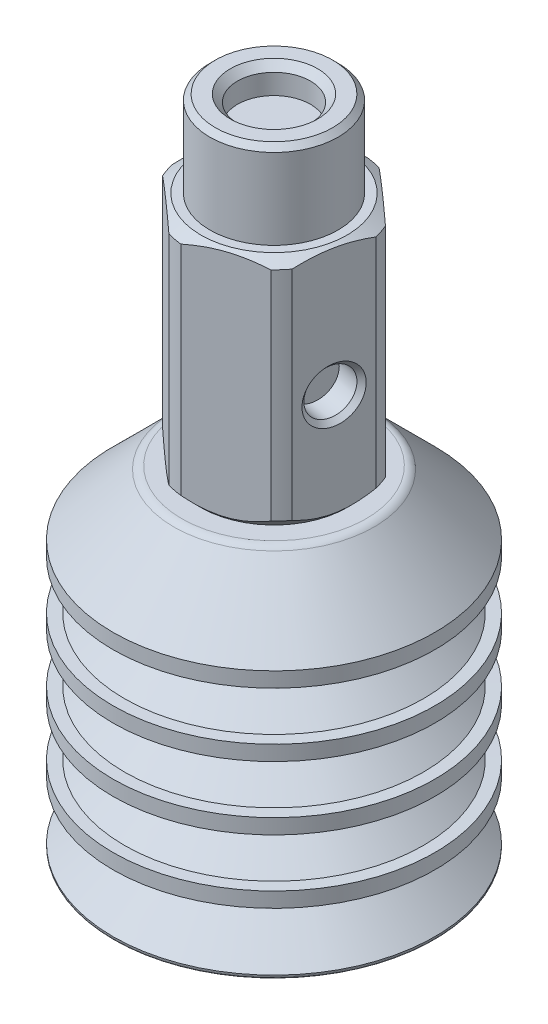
ISO-10303-21;
HEADER;
FILE_DESCRIPTION(('STEP AP214'),'2;1');
FILE_NAME('part.step','',(''),(''),'','','');
FILE_SCHEMA(('AUTOMOTIVE_DESIGN { 1 0 10303 214 1 1 1 1 }'));
ENDSEC;
DATA;
#1=APPLICATION_CONTEXT('core data for automotive mechanical design processes');
#2=APPLICATION_PROTOCOL_DEFINITION('international standard','automotive_design',2000,#1);
#3=PRODUCT_CONTEXT('',#1,'mechanical');
#4=PRODUCT('Part','Part','',(#3));
#5=PRODUCT_RELATED_PRODUCT_CATEGORY('part','',(#4));
#6=PRODUCT_DEFINITION_FORMATION('','',#4);
#7=PRODUCT_DEFINITION_CONTEXT('part definition',#1,'design');
#8=PRODUCT_DEFINITION('design','',#6,#7);
#9=PRODUCT_DEFINITION_SHAPE('','',#8);
#10=(LENGTH_UNIT() NAMED_UNIT(*) SI_UNIT(.MILLI.,.METRE.));
#11=(NAMED_UNIT(*) PLANE_ANGLE_UNIT() SI_UNIT($,.RADIAN.));
#12=(NAMED_UNIT(*) SI_UNIT($,.STERADIAN.) SOLID_ANGLE_UNIT());
#13=UNCERTAINTY_MEASURE_WITH_UNIT(LENGTH_MEASURE(1.E-05),#10,'distance_accuracy_value','');
#14=(GEOMETRIC_REPRESENTATION_CONTEXT(3) GLOBAL_UNCERTAINTY_ASSIGNED_CONTEXT((#13)) GLOBAL_UNIT_ASSIGNED_CONTEXT((#10,
#11,#12)) REPRESENTATION_CONTEXT('',''));
#15=CARTESIAN_POINT('',(0.,0.,0.));
#16=DIRECTION('',(0.,0.,1.));
#17=DIRECTION('',(1.,0.,0.));
#18=AXIS2_PLACEMENT_3D('',#15,#16,#17);
#19=CARTESIAN_POINT('',(-3.11843614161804,30.861,2.27936840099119));
#20=DIRECTION('',(0.,-1.,0.));
#21=DIRECTION('',(0.,0.,-1.));
#22=AXIS2_PLACEMENT_3D('',#19,#20,#21);
#23=PLANE('',#22);
#24=CARTESIAN_POINT('',(-3.11843614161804,30.861,2.27936840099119));
#25=DIRECTION('',(0.,1.,0.));
#26=DIRECTION('',(0.,0.,1.));
#27=AXIS2_PLACEMENT_3D('',#24,#25,#26);
#28=CIRCLE('',#27,8.586547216);
#29=CARTESIAN_POINT('',(-3.11843614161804,30.861,10.8659156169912));
#30=VERTEX_POINT('',#29);
#31=EDGE_CURVE('E161',#30,#30,#28,.T.);
#32=ORIENTED_EDGE('',*,*,#31,.T.);
#33=EDGE_LOOP('',(#32));
#34=FACE_BOUND('',#33,.T.);
#35=CARTESIAN_POINT('',(-3.11843614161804,30.861,2.27936840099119));
#36=DIRECTION('',(0.,-1.,0.));
#37=DIRECTION('',(0.,0.,-1.));
#38=AXIS2_PLACEMENT_3D('',#35,#36,#37);
#39=CIRCLE('',#38,6.79449999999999);
#40=CARTESIAN_POINT('',(-3.11843614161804,30.861,-4.5151315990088));
#41=VERTEX_POINT('',#40);
#42=EDGE_CURVE('E10',#41,#41,#39,.F.);
#43=ORIENTED_EDGE('',*,*,#42,.F.);
#44=EDGE_LOOP('',(#43));
#45=FACE_BOUND('',#44,.T.);
#46=ADVANCED_FACE('F18',(#34,#45),#23,.F.);
#47=CARTESIAN_POINT('',(11.613563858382,0.,2.27936840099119));
#48=DIRECTION('',(0.,1.,0.));
#49=DIRECTION('',(0.,0.,1.));
#50=AXIS2_PLACEMENT_3D('',#47,#48,#49);
#51=PLANE('',#50);
#52=CARTESIAN_POINT('',(-3.11843614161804,0.,2.27936840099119));
#53=DIRECTION('',(0.,1.,0.));
#54=DIRECTION('',(0.,0.,1.));
#55=AXIS2_PLACEMENT_3D('',#52,#53,#54);
#56=CIRCLE('',#55,14.732);
#57=CARTESIAN_POINT('',(-3.11843614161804,0.,17.0113684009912));
#58=VERTEX_POINT('',#57);
#59=EDGE_CURVE('E475',#58,#58,#56,.T.);
#60=ORIENTED_EDGE('',*,*,#59,.F.);
#61=EDGE_LOOP('',(#60));
#62=FACE_BOUND('',#61,.T.);
#63=ADVANCED_FACE('F390',(#62),#51,.F.);
#64=CARTESIAN_POINT('',(-3.11843614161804,0.254000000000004,2.27936840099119));
#65=DIRECTION('',(0.,1.,0.));
#66=DIRECTION('',(0.,0.,1.));
#67=AXIS2_PLACEMENT_3D('',#64,#65,#66);
#68=TOROIDAL_SURFACE('',#67,14.732,0.254000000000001);
#69=CARTESIAN_POINT('',(-3.11843614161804,0.254000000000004,2.27936840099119));
#70=DIRECTION('',(0.,1.,0.));
#71=DIRECTION('',(0.,0.,1.));
#72=AXIS2_PLACEMENT_3D('',#69,#70,#71);
#73=CIRCLE('',#72,14.986);
#74=CARTESIAN_POINT('',(-3.11843614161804,0.254000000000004,17.2653684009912));
#75=VERTEX_POINT('',#74);
#76=EDGE_CURVE('E471',#75,#75,#73,.T.);
#77=ORIENTED_EDGE('',*,*,#76,.F.);
#78=EDGE_LOOP('',(#77));
#79=FACE_BOUND('',#78,.T.);
#80=ORIENTED_EDGE('',*,*,#59,.T.);
#81=EDGE_LOOP('',(#80));
#82=FACE_BOUND('',#81,.T.);
#83=ADVANCED_FACE('F394',(#79,#82),#68,.T.);
#84=CARTESIAN_POINT('',(-3.11843614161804,30.861,2.27936840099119));
#85=DIRECTION('',(0.,1.,0.));
#86=DIRECTION('',(0.,0.,1.));
#87=AXIS2_PLACEMENT_3D('',#84,#85,#86);
#88=CYLINDRICAL_SURFACE('',#87,14.986);
#89=CARTESIAN_POINT('',(-3.11843614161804,0.355600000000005,2.27936840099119));
#90=DIRECTION('',(0.,1.,0.));
#91=DIRECTION('',(0.,0.,1.));
#92=AXIS2_PLACEMENT_3D('',#89,#90,#91);
#93=CIRCLE('',#92,14.986);
#94=CARTESIAN_POINT('',(-3.11843614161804,0.355600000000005,17.2653684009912));
#95=VERTEX_POINT('',#94);
#96=EDGE_CURVE('E467',#95,#95,#93,.T.);
#97=ORIENTED_EDGE('',*,*,#96,.F.);
#98=EDGE_LOOP('',(#97));
#99=FACE_BOUND('',#98,.T.);
#100=ORIENTED_EDGE('',*,*,#76,.T.);
#101=EDGE_LOOP('',(#100));
#102=FACE_BOUND('',#101,.T.);
#103=ADVANCED_FACE('F594',(#99,#102),#88,.T.);
#104=CARTESIAN_POINT('',(-3.11843614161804,0.355600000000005,2.27936840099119));
#105=DIRECTION('',(0.,-1.,0.));
#106=DIRECTION('',(0.,0.,-1.));
#107=AXIS2_PLACEMENT_3D('',#104,#105,#106);
#108=CONICAL_SURFACE('',#107,14.986,0.867428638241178);
#109=CARTESIAN_POINT('',(-3.11843614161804,3.28801160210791,2.27936840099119));
#110=DIRECTION('',(0.,-1.,0.));
#111=DIRECTION('',(0.,0.,-1.));
#112=AXIS2_PLACEMENT_3D('',#109,#110,#111);
#113=CIRCLE('',#112,11.5282189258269);
#114=CARTESIAN_POINT('',(-3.11843614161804,3.28801160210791,-9.24885052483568));
#115=VERTEX_POINT('',#114);
#116=EDGE_CURVE('E481',#115,#115,#113,.T.);
#117=ORIENTED_EDGE('',*,*,#116,.T.);
#118=EDGE_LOOP('',(#117));
#119=FACE_BOUND('',#118,.T.);
#120=ORIENTED_EDGE('',*,*,#96,.T.);
#121=EDGE_LOOP('',(#120));
#122=FACE_BOUND('',#121,.T.);
#123=ADVANCED_FACE('F590',(#119,#122),#108,.T.);
#124=CARTESIAN_POINT('',(-3.11843614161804,3.48172935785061,2.27936840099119));
#125=DIRECTION('',(0.,1.,0.));
#126=DIRECTION('',(0.,0.,1.));
#127=AXIS2_PLACEMENT_3D('',#124,#125,#126);
#128=CONICAL_SURFACE('',#127,11.2997947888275,0.867428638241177);
#129=CARTESIAN_POINT('',(-3.11843614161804,3.67544711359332,2.27936840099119));
#130=DIRECTION('',(0.,1.,0.));
#131=DIRECTION('',(0.,0.,1.));
#132=AXIS2_PLACEMENT_3D('',#129,#130,#131);
#133=CIRCLE('',#132,11.5282189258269);
#134=CARTESIAN_POINT('',(-3.11843614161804,3.67544711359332,13.8075873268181));
#135=VERTEX_POINT('',#134);
#136=EDGE_CURVE('E478',#135,#135,#133,.T.);
#137=ORIENTED_EDGE('',*,*,#136,.T.);
#138=EDGE_LOOP('',(#137));
#139=FACE_BOUND('',#138,.T.);
#140=CARTESIAN_POINT('',(-3.11843614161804,5.70314652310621,2.27936840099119));
#141=DIRECTION('',(0.,1.,0.));
#142=DIRECTION('',(0.,0.,1.));
#143=AXIS2_PLACEMENT_3D('',#140,#141,#142);
#144=CIRCLE('',#143,13.9192);
#145=CARTESIAN_POINT('',(-3.11843614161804,5.70314652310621,16.1985684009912));
#146=VERTEX_POINT('',#145);
#147=EDGE_CURVE('E464',#146,#146,#144,.T.);
#148=ORIENTED_EDGE('',*,*,#147,.F.);
#149=EDGE_LOOP('',(#148));
#150=FACE_BOUND('',#149,.T.);
#151=ADVANCED_FACE('F586',(#139,#150),#128,.T.);
#152=CARTESIAN_POINT('',(-3.11843614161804,5.70314652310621,2.27936840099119));
#153=DIRECTION('',(0.,1.,0.));
#154=DIRECTION('',(0.,0.,1.));
#155=AXIS2_PLACEMENT_3D('',#152,#153,#154);
#156=CONICAL_SURFACE('',#155,13.9192,1.53588974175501);
#157=CARTESIAN_POINT('',(-3.11843614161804,5.7404,2.27936840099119));
#158=DIRECTION('',(0.,1.,0.));
#159=DIRECTION('',(0.,0.,1.));
#160=AXIS2_PLACEMENT_3D('',#157,#158,#159);
#161=CIRCLE('',#160,14.986);
#162=CARTESIAN_POINT('',(-3.11843614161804,5.7404,17.2653684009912));
#163=VERTEX_POINT('',#162);
#164=EDGE_CURVE('E460',#163,#163,#161,.T.);
#165=ORIENTED_EDGE('',*,*,#164,.F.);
#166=EDGE_LOOP('',(#165));
#167=FACE_BOUND('',#166,.T.);
#168=ORIENTED_EDGE('',*,*,#147,.T.);
#169=EDGE_LOOP('',(#168));
#170=FACE_BOUND('',#169,.T.);
#171=ADVANCED_FACE('F582',(#167,#170),#156,.T.);
#172=CARTESIAN_POINT('',(-3.11843614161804,30.861,2.27936840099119));
#173=DIRECTION('',(0.,1.,0.));
#174=DIRECTION('',(0.,0.,1.));
#175=AXIS2_PLACEMENT_3D('',#172,#173,#174);
#176=CYLINDRICAL_SURFACE('',#175,14.986);
#177=CARTESIAN_POINT('',(-3.11843614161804,7.1374,2.27936840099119));
#178=DIRECTION('',(0.,1.,0.));
#179=DIRECTION('',(0.,0.,1.));
#180=AXIS2_PLACEMENT_3D('',#177,#178,#179);
#181=CIRCLE('',#180,14.986);
#182=CARTESIAN_POINT('',(-3.11843614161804,7.1374,17.2653684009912));
#183=VERTEX_POINT('',#182);
#184=EDGE_CURVE('E456',#183,#183,#181,.T.);
#185=ORIENTED_EDGE('',*,*,#184,.F.);
#186=EDGE_LOOP('',(#185));
#187=FACE_BOUND('',#186,.T.);
#188=ORIENTED_EDGE('',*,*,#164,.T.);
#189=EDGE_LOOP('',(#188));
#190=FACE_BOUND('',#189,.T.);
#191=ADVANCED_FACE('F578',(#187,#190),#176,.T.);
#192=CARTESIAN_POINT('',(-3.11843614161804,7.1374,2.27936840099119));
#193=DIRECTION('',(0.,-1.,0.));
#194=DIRECTION('',(0.,0.,-1.));
#195=AXIS2_PLACEMENT_3D('',#192,#193,#194);
#196=CONICAL_SURFACE('',#195,14.986,1.53588974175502);
#197=CARTESIAN_POINT('',(-3.11843614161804,7.17465347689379,2.27936840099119));
#198=DIRECTION('',(0.,1.,0.));
#199=DIRECTION('',(0.,0.,1.));
#200=AXIS2_PLACEMENT_3D('',#197,#198,#199);
#201=CIRCLE('',#200,13.9192);
#202=CARTESIAN_POINT('',(-3.11843614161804,7.17465347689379,16.1985684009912));
#203=VERTEX_POINT('',#202);
#204=EDGE_CURVE('E452',#203,#203,#201,.T.);
#205=ORIENTED_EDGE('',*,*,#204,.F.);
#206=EDGE_LOOP('',(#205));
#207=FACE_BOUND('',#206,.T.);
#208=ORIENTED_EDGE('',*,*,#184,.T.);
#209=EDGE_LOOP('',(#208));
#210=FACE_BOUND('',#209,.T.);
#211=ADVANCED_FACE('F574',(#207,#210),#196,.T.);
#212=CARTESIAN_POINT('',(-3.11843614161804,7.17465347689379,2.27936840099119));
#213=DIRECTION('',(0.,-1.,0.));
#214=DIRECTION('',(0.,0.,-1.));
#215=AXIS2_PLACEMENT_3D('',#212,#213,#214);
#216=CONICAL_SURFACE('',#215,13.9192,0.867428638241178);
#217=CARTESIAN_POINT('',(-3.11843614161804,9.2042822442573,2.27936840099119));
#218=DIRECTION('',(0.,-1.,0.));
#219=DIRECTION('',(0.,0.,-1.));
#220=AXIS2_PLACEMENT_3D('',#217,#218,#219);
#221=CIRCLE('',#220,11.5259439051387);
#222=CARTESIAN_POINT('',(-3.11843614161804,9.2042822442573,-9.24657550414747));
#223=VERTEX_POINT('',#222);
#224=EDGE_CURVE('E488',#223,#223,#221,.T.);
#225=ORIENTED_EDGE('',*,*,#224,.T.);
#226=EDGE_LOOP('',(#225));
#227=FACE_BOUND('',#226,.T.);
#228=ORIENTED_EDGE('',*,*,#204,.T.);
#229=EDGE_LOOP('',(#228));
#230=FACE_BOUND('',#229,.T.);
#231=ADVANCED_FACE('F570',(#227,#230),#216,.T.);
#232=CARTESIAN_POINT('',(-3.11843614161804,9.398,2.27936840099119));
#233=DIRECTION('',(0.,1.,0.));
#234=DIRECTION('',(0.,0.,1.));
#235=AXIS2_PLACEMENT_3D('',#232,#233,#234);
#236=CONICAL_SURFACE('',#235,11.2975197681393,0.867428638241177);
#237=CARTESIAN_POINT('',(-3.11843614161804,9.5917177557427,2.27936840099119));
#238=DIRECTION('',(0.,1.,0.));
#239=DIRECTION('',(0.,0.,1.));
#240=AXIS2_PLACEMENT_3D('',#237,#238,#239);
#241=CIRCLE('',#240,11.5259439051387);
#242=CARTESIAN_POINT('',(-3.11843614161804,9.5917177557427,13.8053123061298));
#243=VERTEX_POINT('',#242);
#244=EDGE_CURVE('E484',#243,#243,#241,.T.);
#245=ORIENTED_EDGE('',*,*,#244,.T.);
#246=EDGE_LOOP('',(#245));
#247=FACE_BOUND('',#246,.T.);
#248=CARTESIAN_POINT('',(-3.11843614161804,11.6213465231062,2.27936840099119));
#249=DIRECTION('',(0.,1.,0.));
#250=DIRECTION('',(0.,0.,1.));
#251=AXIS2_PLACEMENT_3D('',#248,#249,#250);
#252=CIRCLE('',#251,13.9192);
#253=CARTESIAN_POINT('',(-3.11843614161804,11.6213465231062,16.1985684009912));
#254=VERTEX_POINT('',#253);
#255=EDGE_CURVE('E449',#254,#254,#252,.T.);
#256=ORIENTED_EDGE('',*,*,#255,.F.);
#257=EDGE_LOOP('',(#256));
#258=FACE_BOUND('',#257,.T.);
#259=ADVANCED_FACE('F566',(#247,#258),#236,.T.);
#260=CARTESIAN_POINT('',(-3.11843614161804,11.6213465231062,2.27936840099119));
#261=DIRECTION('',(0.,1.,0.));
#262=DIRECTION('',(0.,0.,1.));
#263=AXIS2_PLACEMENT_3D('',#260,#261,#262);
#264=CONICAL_SURFACE('',#263,13.9192,1.53588974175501);
#265=CARTESIAN_POINT('',(-3.11843614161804,11.6586,2.27936840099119));
#266=DIRECTION('',(0.,1.,0.));
#267=DIRECTION('',(0.,0.,1.));
#268=AXIS2_PLACEMENT_3D('',#265,#266,#267);
#269=CIRCLE('',#268,14.986);
#270=CARTESIAN_POINT('',(-3.11843614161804,11.6586,17.2653684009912));
#271=VERTEX_POINT('',#270);
#272=EDGE_CURVE('E445',#271,#271,#269,.T.);
#273=ORIENTED_EDGE('',*,*,#272,.F.);
#274=EDGE_LOOP('',(#273));
#275=FACE_BOUND('',#274,.T.);
#276=ORIENTED_EDGE('',*,*,#255,.T.);
#277=EDGE_LOOP('',(#276));
#278=FACE_BOUND('',#277,.T.);
#279=ADVANCED_FACE('F562',(#275,#278),#264,.T.);
#280=CARTESIAN_POINT('',(-3.11843614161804,30.861,2.27936840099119));
#281=DIRECTION('',(0.,1.,0.));
#282=DIRECTION('',(0.,0.,1.));
#283=AXIS2_PLACEMENT_3D('',#280,#281,#282);
#284=CYLINDRICAL_SURFACE('',#283,14.986);
#285=CARTESIAN_POINT('',(-3.11843614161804,13.0556,2.27936840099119));
#286=DIRECTION('',(0.,1.,0.));
#287=DIRECTION('',(0.,0.,1.));
#288=AXIS2_PLACEMENT_3D('',#285,#286,#287);
#289=CIRCLE('',#288,14.986);
#290=CARTESIAN_POINT('',(-3.11843614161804,13.0556,17.2653684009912));
#291=VERTEX_POINT('',#290);
#292=EDGE_CURVE('E441',#291,#291,#289,.T.);
#293=ORIENTED_EDGE('',*,*,#292,.F.);
#294=EDGE_LOOP('',(#293));
#295=FACE_BOUND('',#294,.T.);
#296=ORIENTED_EDGE('',*,*,#272,.T.);
#297=EDGE_LOOP('',(#296));
#298=FACE_BOUND('',#297,.T.);
#299=ADVANCED_FACE('F558',(#295,#298),#284,.T.);
#300=CARTESIAN_POINT('',(-3.11843614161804,13.0556,2.27936840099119));
#301=DIRECTION('',(0.,-1.,0.));
#302=DIRECTION('',(0.,0.,-1.));
#303=AXIS2_PLACEMENT_3D('',#300,#301,#302);
#304=CONICAL_SURFACE('',#303,14.986,1.53588974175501);
#305=CARTESIAN_POINT('',(-3.11843614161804,13.0928534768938,2.27936840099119));
#306=DIRECTION('',(0.,1.,0.));
#307=DIRECTION('',(0.,0.,1.));
#308=AXIS2_PLACEMENT_3D('',#305,#306,#307);
#309=CIRCLE('',#308,13.9192);
#310=CARTESIAN_POINT('',(-3.11843614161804,13.0928534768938,16.1985684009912));
#311=VERTEX_POINT('',#310);
#312=EDGE_CURVE('E437',#311,#311,#309,.T.);
#313=ORIENTED_EDGE('',*,*,#312,.F.);
#314=EDGE_LOOP('',(#313));
#315=FACE_BOUND('',#314,.T.);
#316=ORIENTED_EDGE('',*,*,#292,.T.);
#317=EDGE_LOOP('',(#316));
#318=FACE_BOUND('',#317,.T.);
#319=ADVANCED_FACE('F554',(#315,#318),#304,.T.);
#320=CARTESIAN_POINT('',(-3.11843614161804,13.0928534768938,2.27936840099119));
#321=DIRECTION('',(0.,-1.,0.));
#322=DIRECTION('',(0.,0.,-1.));
#323=AXIS2_PLACEMENT_3D('',#320,#321,#322);
#324=CONICAL_SURFACE('',#323,13.9192,0.867428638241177);
#325=CARTESIAN_POINT('',(-3.11843614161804,15.1224822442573,2.27936840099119));
#326=DIRECTION('',(0.,-1.,0.));
#327=DIRECTION('',(0.,0.,-1.));
#328=AXIS2_PLACEMENT_3D('',#325,#326,#327);
#329=CIRCLE('',#328,11.5259439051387);
#330=CARTESIAN_POINT('',(-3.11843614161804,15.1224822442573,-9.24657550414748));
#331=VERTEX_POINT('',#330);
#332=EDGE_CURVE('E495',#331,#331,#329,.T.);
#333=ORIENTED_EDGE('',*,*,#332,.T.);
#334=EDGE_LOOP('',(#333));
#335=FACE_BOUND('',#334,.T.);
#336=ORIENTED_EDGE('',*,*,#312,.T.);
#337=EDGE_LOOP('',(#336));
#338=FACE_BOUND('',#337,.T.);
#339=ADVANCED_FACE('F550',(#335,#338),#324,.T.);
#340=CARTESIAN_POINT('',(-3.11843614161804,15.3162,2.27936840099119));
#341=DIRECTION('',(0.,1.,0.));
#342=DIRECTION('',(0.,0.,1.));
#343=AXIS2_PLACEMENT_3D('',#340,#341,#342);
#344=CONICAL_SURFACE('',#343,11.2975197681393,0.867428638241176);
#345=CARTESIAN_POINT('',(-3.11843614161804,15.5099177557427,2.27936840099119));
#346=DIRECTION('',(0.,1.,0.));
#347=DIRECTION('',(0.,0.,1.));
#348=AXIS2_PLACEMENT_3D('',#345,#346,#347);
#349=CIRCLE('',#348,11.5259439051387);
#350=CARTESIAN_POINT('',(-3.11843614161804,15.5099177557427,13.8053123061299));
#351=VERTEX_POINT('',#350);
#352=EDGE_CURVE('E492',#351,#351,#349,.T.);
#353=ORIENTED_EDGE('',*,*,#352,.T.);
#354=EDGE_LOOP('',(#353));
#355=FACE_BOUND('',#354,.T.);
#356=CARTESIAN_POINT('',(-3.11843614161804,17.5395465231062,2.27936840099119));
#357=DIRECTION('',(0.,1.,0.));
#358=DIRECTION('',(0.,0.,1.));
#359=AXIS2_PLACEMENT_3D('',#356,#357,#358);
#360=CIRCLE('',#359,13.9192);
#361=CARTESIAN_POINT('',(-3.11843614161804,17.5395465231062,16.1985684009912));
#362=VERTEX_POINT('',#361);
#363=EDGE_CURVE('E434',#362,#362,#360,.T.);
#364=ORIENTED_EDGE('',*,*,#363,.F.);
#365=EDGE_LOOP('',(#364));
#366=FACE_BOUND('',#365,.T.);
#367=ADVANCED_FACE('F546',(#355,#366),#344,.T.);
#368=CARTESIAN_POINT('',(-3.11843614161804,17.5395465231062,2.27936840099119));
#369=DIRECTION('',(0.,1.,0.));
#370=DIRECTION('',(0.,0.,1.));
#371=AXIS2_PLACEMENT_3D('',#368,#369,#370);
#372=CONICAL_SURFACE('',#371,13.9192,1.53588974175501);
#373=CARTESIAN_POINT('',(-3.11843614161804,17.5768,2.27936840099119));
#374=DIRECTION('',(0.,1.,0.));
#375=DIRECTION('',(0.,0.,1.));
#376=AXIS2_PLACEMENT_3D('',#373,#374,#375);
#377=CIRCLE('',#376,14.986);
#378=CARTESIAN_POINT('',(-3.11843614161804,17.5768,17.2653684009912));
#379=VERTEX_POINT('',#378);
#380=EDGE_CURVE('E431',#379,#379,#377,.T.);
#381=ORIENTED_EDGE('',*,*,#380,.F.);
#382=EDGE_LOOP('',(#381));
#383=FACE_BOUND('',#382,.T.);
#384=ORIENTED_EDGE('',*,*,#363,.T.);
#385=EDGE_LOOP('',(#384));
#386=FACE_BOUND('',#385,.T.);
#387=ADVANCED_FACE('F542',(#383,#386),#372,.T.);
#388=CARTESIAN_POINT('',(-3.11843614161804,30.861,2.27936840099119));
#389=DIRECTION('',(0.,1.,0.));
#390=DIRECTION('',(0.,0.,1.));
#391=AXIS2_PLACEMENT_3D('',#388,#389,#390);
#392=CYLINDRICAL_SURFACE('',#391,14.986);
#393=CARTESIAN_POINT('',(-3.11843614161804,18.9738,2.27936840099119));
#394=DIRECTION('',(0.,1.,0.));
#395=DIRECTION('',(0.,0.,1.));
#396=AXIS2_PLACEMENT_3D('',#393,#394,#395);
#397=CIRCLE('',#396,14.986);
#398=CARTESIAN_POINT('',(-3.11843614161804,18.9738,17.2653684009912));
#399=VERTEX_POINT('',#398);
#400=EDGE_CURVE('E427',#399,#399,#397,.T.);
#401=ORIENTED_EDGE('',*,*,#400,.F.);
#402=EDGE_LOOP('',(#401));
#403=FACE_BOUND('',#402,.T.);
#404=ORIENTED_EDGE('',*,*,#380,.T.);
#405=EDGE_LOOP('',(#404));
#406=FACE_BOUND('',#405,.T.);
#407=ADVANCED_FACE('F538',(#403,#406),#392,.T.);
#408=CARTESIAN_POINT('',(-3.11843614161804,18.9738,2.27936840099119));
#409=DIRECTION('',(0.,-1.,0.));
#410=DIRECTION('',(0.,0.,-1.));
#411=AXIS2_PLACEMENT_3D('',#408,#409,#410);
#412=CONICAL_SURFACE('',#411,14.986,1.53588974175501);
#413=CARTESIAN_POINT('',(-3.11843614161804,19.0110534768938,2.27936840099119));
#414=DIRECTION('',(0.,1.,0.));
#415=DIRECTION('',(0.,0.,1.));
#416=AXIS2_PLACEMENT_3D('',#413,#414,#415);
#417=CIRCLE('',#416,13.9192);
#418=CARTESIAN_POINT('',(-3.11843614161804,19.0110534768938,16.1985684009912));
#419=VERTEX_POINT('',#418);
#420=EDGE_CURVE('E424',#419,#419,#417,.T.);
#421=ORIENTED_EDGE('',*,*,#420,.F.);
#422=EDGE_LOOP('',(#421));
#423=FACE_BOUND('',#422,.T.);
#424=ORIENTED_EDGE('',*,*,#400,.T.);
#425=EDGE_LOOP('',(#424));
#426=FACE_BOUND('',#425,.T.);
#427=ADVANCED_FACE('F535',(#423,#426),#412,.T.);
#428=CARTESIAN_POINT('',(-3.11843614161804,19.0110534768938,2.27936840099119));
#429=DIRECTION('',(0.,-1.,0.));
#430=DIRECTION('',(0.,0.,-1.));
#431=AXIS2_PLACEMENT_3D('',#428,#429,#430);
#432=CONICAL_SURFACE('',#431,13.9192,0.867428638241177);
#433=CARTESIAN_POINT('',(-3.11843614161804,21.0406822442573,2.27936840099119));
#434=DIRECTION('',(0.,-1.,0.));
#435=DIRECTION('',(0.,0.,-1.));
#436=AXIS2_PLACEMENT_3D('',#433,#434,#435);
#437=CIRCLE('',#436,11.5259439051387);
#438=CARTESIAN_POINT('',(-3.11843614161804,21.0406822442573,-9.24657550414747));
#439=VERTEX_POINT('',#438);
#440=EDGE_CURVE('E27',#439,#439,#437,.T.);
#441=ORIENTED_EDGE('',*,*,#440,.T.);
#442=EDGE_LOOP('',(#441));
#443=FACE_BOUND('',#442,.T.);
#444=ORIENTED_EDGE('',*,*,#420,.T.);
#445=EDGE_LOOP('',(#444));
#446=FACE_BOUND('',#445,.T.);
#447=ADVANCED_FACE('F507',(#443,#446),#432,.T.);
#448=CARTESIAN_POINT('',(-3.11843614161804,21.2344,2.27936840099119));
#449=DIRECTION('',(0.,1.,0.));
#450=DIRECTION('',(0.,0.,1.));
#451=AXIS2_PLACEMENT_3D('',#448,#449,#450);
#452=CONICAL_SURFACE('',#451,11.2975197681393,0.867428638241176);
#453=CARTESIAN_POINT('',(-3.11843614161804,21.4281177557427,2.27936840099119));
#454=DIRECTION('',(0.,1.,0.));
#455=DIRECTION('',(0.,0.,1.));
#456=AXIS2_PLACEMENT_3D('',#453,#454,#455);
#457=CIRCLE('',#456,11.5259439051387);
#458=CARTESIAN_POINT('',(-3.11843614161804,21.4281177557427,13.8053123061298));
#459=VERTEX_POINT('',#458);
#460=EDGE_CURVE('E499',#459,#459,#457,.T.);
#461=ORIENTED_EDGE('',*,*,#460,.T.);
#462=EDGE_LOOP('',(#461));
#463=FACE_BOUND('',#462,.T.);
#464=CARTESIAN_POINT('',(-3.11843614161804,23.4577465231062,2.27936840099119));
#465=DIRECTION('',(0.,1.,0.));
#466=DIRECTION('',(0.,0.,1.));
#467=AXIS2_PLACEMENT_3D('',#464,#465,#466);
#468=CIRCLE('',#467,13.9192);
#469=CARTESIAN_POINT('',(-3.11843614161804,23.4577465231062,16.1985684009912));
#470=VERTEX_POINT('',#469);
#471=EDGE_CURVE('E420',#470,#470,#468,.T.);
#472=ORIENTED_EDGE('',*,*,#471,.F.);
#473=EDGE_LOOP('',(#472));
#474=FACE_BOUND('',#473,.T.);
#475=ADVANCED_FACE('F515',(#463,#474),#452,.T.);
#476=CARTESIAN_POINT('',(-3.11843614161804,23.4577465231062,2.27936840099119));
#477=DIRECTION('',(0.,1.,0.));
#478=DIRECTION('',(0.,0.,1.));
#479=AXIS2_PLACEMENT_3D('',#476,#477,#478);
#480=CONICAL_SURFACE('',#479,13.9192,1.53588974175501);
#481=CARTESIAN_POINT('',(-3.11843614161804,23.495,2.27936840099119));
#482=DIRECTION('',(0.,1.,0.));
#483=DIRECTION('',(0.,0.,1.));
#484=AXIS2_PLACEMENT_3D('',#481,#482,#483);
#485=CIRCLE('',#484,14.986);
#486=CARTESIAN_POINT('',(-3.11843614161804,23.495,17.2653684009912));
#487=VERTEX_POINT('',#486);
#488=EDGE_CURVE('E414',#487,#487,#485,.T.);
#489=ORIENTED_EDGE('',*,*,#488,.F.);
#490=EDGE_LOOP('',(#489));
#491=FACE_BOUND('',#490,.T.);
#492=ORIENTED_EDGE('',*,*,#471,.T.);
#493=EDGE_LOOP('',(#492));
#494=FACE_BOUND('',#493,.T.);
#495=ADVANCED_FACE('F518',(#491,#494),#480,.T.);
#496=CARTESIAN_POINT('',(-3.11843614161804,30.861,2.27936840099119));
#497=DIRECTION('',(0.,1.,0.));
#498=DIRECTION('',(0.,0.,1.));
#499=AXIS2_PLACEMENT_3D('',#496,#497,#498);
#500=CYLINDRICAL_SURFACE('',#499,14.986);
#501=CARTESIAN_POINT('',(-3.11843614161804,24.892,2.27936840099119));
#502=DIRECTION('',(0.,1.,0.));
#503=DIRECTION('',(0.,0.,1.));
#504=AXIS2_PLACEMENT_3D('',#501,#502,#503);
#505=CIRCLE('',#504,14.986);
#506=CARTESIAN_POINT('',(-3.11843614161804,24.892,17.2653684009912));
#507=VERTEX_POINT('',#506);
#508=EDGE_CURVE('E409',#507,#507,#505,.T.);
#509=ORIENTED_EDGE('',*,*,#508,.F.);
#510=EDGE_LOOP('',(#509));
#511=FACE_BOUND('',#510,.T.);
#512=ORIENTED_EDGE('',*,*,#488,.T.);
#513=EDGE_LOOP('',(#512));
#514=FACE_BOUND('',#513,.T.);
#515=ADVANCED_FACE('F523',(#511,#514),#500,.T.);
#516=CARTESIAN_POINT('',(-3.11843614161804,24.892,2.27936840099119));
#517=DIRECTION('',(0.,-1.,0.));
#518=DIRECTION('',(0.,0.,-1.));
#519=AXIS2_PLACEMENT_3D('',#516,#517,#518);
#520=CONICAL_SURFACE('',#519,14.986,0.785398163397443);
#521=CARTESIAN_POINT('',(-3.11843614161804,30.5566239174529,2.27936840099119));
#522=DIRECTION('',(0.,1.,0.));
#523=DIRECTION('',(0.,0.,1.));
#524=AXIS2_PLACEMENT_3D('',#521,#522,#523);
#525=CIRCLE('',#524,9.32137608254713);
#526=CARTESIAN_POINT('',(-3.11843614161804,30.5566239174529,11.6007444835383));
#527=VERTEX_POINT('',#526);
#528=EDGE_CURVE('E168',#527,#527,#525,.T.);
#529=ORIENTED_EDGE('',*,*,#528,.F.);
#530=EDGE_LOOP('',(#529));
#531=FACE_BOUND('',#530,.T.);
#532=ORIENTED_EDGE('',*,*,#508,.T.);
#533=EDGE_LOOP('',(#532));
#534=FACE_BOUND('',#533,.T.);
#535=ADVANCED_FACE('F405',(#531,#534),#520,.T.);
#536=CARTESIAN_POINT('',(-3.11843614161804,29.8217950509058,2.27936840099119));
#537=DIRECTION('',(0.,1.,0.));
#538=DIRECTION('',(0.,0.,1.));
#539=AXIS2_PLACEMENT_3D('',#536,#537,#538);
#540=TOROIDAL_SURFACE('',#539,8.586547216,1.0392049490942);
#541=ORIENTED_EDGE('',*,*,#31,.F.);
#542=EDGE_LOOP('',(#541));
#543=FACE_BOUND('',#542,.T.);
#544=ORIENTED_EDGE('',*,*,#528,.T.);
#545=EDGE_LOOP('',(#544));
#546=FACE_BOUND('',#545,.T.);
#547=ADVANCED_FACE('F401',(#543,#546),#540,.T.);
#548=CARTESIAN_POINT('',(-3.11843614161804,3.48172935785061,2.27936840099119));
#549=DIRECTION('',(0.,1.,0.));
#550=DIRECTION('',(0.,0.,1.));
#551=AXIS2_PLACEMENT_3D('',#548,#549,#550);
#552=TOROIDAL_SURFACE('',#551,11.6925035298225,0.254);
#553=ORIENTED_EDGE('',*,*,#116,.F.);
#554=EDGE_LOOP('',(#553));
#555=FACE_BOUND('',#554,.T.);
#556=ORIENTED_EDGE('',*,*,#136,.F.);
#557=EDGE_LOOP('',(#556));
#558=FACE_BOUND('',#557,.T.);
#559=ADVANCED_FACE('F404',(#555,#558),#552,.F.);
#560=CARTESIAN_POINT('',(-3.11843614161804,9.398,2.27936840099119));
#561=DIRECTION('',(0.,1.,0.));
#562=DIRECTION('',(0.,0.,1.));
#563=AXIS2_PLACEMENT_3D('',#560,#561,#562);
#564=TOROIDAL_SURFACE('',#563,11.6902285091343,0.254);
#565=ORIENTED_EDGE('',*,*,#224,.F.);
#566=EDGE_LOOP('',(#565));
#567=FACE_BOUND('',#566,.T.);
#568=ORIENTED_EDGE('',*,*,#244,.F.);
#569=EDGE_LOOP('',(#568));
#570=FACE_BOUND('',#569,.T.);
#571=ADVANCED_FACE('F604',(#567,#570),#564,.F.);
#572=CARTESIAN_POINT('',(-3.11843614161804,15.3162,2.27936840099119));
#573=DIRECTION('',(0.,1.,0.));
#574=DIRECTION('',(0.,0.,1.));
#575=AXIS2_PLACEMENT_3D('',#572,#573,#574);
#576=TOROIDAL_SURFACE('',#575,11.6902285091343,0.254);
#577=ORIENTED_EDGE('',*,*,#332,.F.);
#578=EDGE_LOOP('',(#577));
#579=FACE_BOUND('',#578,.T.);
#580=ORIENTED_EDGE('',*,*,#352,.F.);
#581=EDGE_LOOP('',(#580));
#582=FACE_BOUND('',#581,.T.);
#583=ADVANCED_FACE('F512',(#579,#582),#576,.F.);
#584=CARTESIAN_POINT('',(-3.11843614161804,21.2344,2.27936840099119));
#585=DIRECTION('',(0.,1.,0.));
#586=DIRECTION('',(0.,0.,1.));
#587=AXIS2_PLACEMENT_3D('',#584,#585,#586);
#588=TOROIDAL_SURFACE('',#587,11.6902285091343,0.254);
#589=ORIENTED_EDGE('',*,*,#440,.F.);
#590=EDGE_LOOP('',(#589));
#591=FACE_BOUND('',#590,.T.);
#592=ORIENTED_EDGE('',*,*,#460,.F.);
#593=EDGE_LOOP('',(#592));
#594=FACE_BOUND('',#593,.T.);
#595=ADVANCED_FACE('F20',(#591,#594),#588,.F.);
#596=CARTESIAN_POINT('',(-3.11843614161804,31.9405,2.27936840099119));
#597=DIRECTION('',(0.,1.,0.));
#598=DIRECTION('',(-0.197193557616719,0.,0.980364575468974));
#599=AXIS2_PLACEMENT_3D('',#596,#597,#598);
#600=CONICAL_SURFACE('',#599,7.874,0.785398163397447);
#601=ORIENTED_EDGE('',*,*,#42,.T.);
#602=EDGE_LOOP('',(#601));
#603=FACE_BOUND('',#602,.T.);
#604=CARTESIAN_POINT('',(-3.97525058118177,31.9407,10.1068133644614));
#605=CARTESIAN_POINT('',(-3.74522773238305,31.8385881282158,10.0292809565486));
#606=CARTESIAN_POINT('',(-3.51179916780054,31.744216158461,9.95060060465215));
#607=CARTESIAN_POINT('',(-3.03795687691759,31.5747566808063,9.79088545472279));
#608=CARTESIAN_POINT('',(-2.79752328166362,31.4997315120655,9.70984395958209));
#609=CARTESIAN_POINT('',(-2.31343134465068,31.3741115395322,9.54667402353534));
#610=CARTESIAN_POINT('',(-2.06983027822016,31.3232771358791,9.4645648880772));
#611=CARTESIAN_POINT('',(-1.57919804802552,31.2485416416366,9.29919045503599));
#612=CARTESIAN_POINT('',(-1.33217189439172,31.2246047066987,9.2159268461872));
#613=CARTESIAN_POINT('',(-0.850361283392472,31.2059896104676,9.05352586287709));
#614=CARTESIAN_POINT('',(-0.615628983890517,31.2098145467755,8.9744060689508));
#615=CARTESIAN_POINT('',(-0.147695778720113,31.2429221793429,8.81668265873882));
#616=CARTESIAN_POINT('',(0.085504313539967,31.2722174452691,8.73807931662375));
#617=CARTESIAN_POINT('',(0.547956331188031,31.35417860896,8.58220341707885));
#618=CARTESIAN_POINT('',(0.777210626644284,31.4068299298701,8.50493006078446));
#619=CARTESIAN_POINT('',(1.2306822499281,31.5323750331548,8.3520811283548));
#620=CARTESIAN_POINT('',(1.45489834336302,31.605273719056,8.27650596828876));
#621=CARTESIAN_POINT('',(1.78195597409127,31.7253817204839,8.16626663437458));
#622=CARTESIAN_POINT('',(1.88699433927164,31.7661079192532,8.13086198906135));
#623=CARTESIAN_POINT('',(2.09553162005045,31.8509398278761,8.0605715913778));
#624=CARTESIAN_POINT('',(2.19903378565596,31.8950366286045,8.02568474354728));
#625=CARTESIAN_POINT('',(2.30191520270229,31.9407,7.99100712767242));
#626=B_SPLINE_CURVE_WITH_KNOTS('',3,(#604,#605,#606,#607,#608,#609,#610,#611,#612,#613,#614,
#615,#616,#617,#618,#619,#620,#621,#622,#623,#624,#625),.UNSPECIFIED.,.F.,.F.,(4,2,2,2,2,2,2,2,
2,2,4),(0.,0.790360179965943,1.58323609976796,2.36808644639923,3.15188963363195,
3.89375725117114,4.63599119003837,5.37776254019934,6.11971369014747,6.47393635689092,
6.82725313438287),.UNSPECIFIED.);
#627=CARTESIAN_POINT('',(-3.97479997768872,31.9405,10.1066614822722));
#628=VERTEX_POINT('',#627);
#629=CARTESIAN_POINT('',(2.30146459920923,31.9405,7.99115900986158));
#630=VERTEX_POINT('',#629);
#631=EDGE_CURVE('E39',#628,#630,#626,.T.);
#632=ORIENTED_EDGE('',*,*,#631,.F.);
#633=CARTESIAN_POINT('',(-3.11843614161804,31.9405,2.27936840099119));
#634=DIRECTION('',(0.,-1.,0.));
#635=DIRECTION('',(0.197193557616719,0.,-0.980364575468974));
#636=AXIS2_PLACEMENT_3D('',#633,#634,#635);
#637=CIRCLE('',#636,7.874);
#638=CARTESIAN_POINT('',(-5.35504153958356,31.9405,9.8290354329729));
#639=VERTEX_POINT('',#638);
#640=EDGE_CURVE('E155',#628,#639,#637,.T.);
#641=ORIENTED_EDGE('',*,*,#640,.T.);
#642=CARTESIAN_POINT('',(-10.3256095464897,31.9407,5.45106781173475));
#643=CARTESIAN_POINT('',(-10.1434530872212,31.8385881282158,5.61150723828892));
#644=CARTESIAN_POINT('',(-9.95859962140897,31.744216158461,5.77432212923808));
#645=CARTESIAN_POINT('',(-9.58336109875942,31.5747566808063,6.10482401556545));
#646=CARTESIAN_POINT('',(-9.39296030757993,31.4997315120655,6.27252486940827));
#647=CARTESIAN_POINT('',(-9.00960502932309,31.3741115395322,6.61017581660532));
#648=CARTESIAN_POINT('',(-8.8166958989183,31.3232771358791,6.78008596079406));
#649=CARTESIAN_POINT('',(-8.42816132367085,31.2485416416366,7.12229871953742));
#650=CARTESIAN_POINT('',(-8.23253984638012,31.2246047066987,7.29459783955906));
#651=CARTESIAN_POINT('',(-7.85099116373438,31.2059896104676,7.63065757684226));
#652=CARTESIAN_POINT('',(-7.66510526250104,31.2098145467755,7.79438181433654));
#653=CARTESIAN_POINT('',(-7.29454617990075,31.2429221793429,8.12076215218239));
#654=CARTESIAN_POINT('',(-7.1098736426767,31.2722174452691,8.28341768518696));
#655=CARTESIAN_POINT('',(-6.74365514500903,31.35417860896,8.60597493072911));
#656=CARTESIAN_POINT('',(-6.56210730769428,31.4068299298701,8.76587829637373));
#657=CARTESIAN_POINT('',(-6.20300043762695,31.5323750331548,9.08217177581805));
#658=CARTESIAN_POINT('',(-6.02544238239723,31.605273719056,9.23856102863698));
#659=CARTESIAN_POINT('',(-5.7664435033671,31.7253817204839,9.46668157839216));
#660=CARTESIAN_POINT('',(-5.68326299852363,31.7661079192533,9.53994514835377));
#661=CARTESIAN_POINT('',(-5.51812108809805,31.8509398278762,9.68539853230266));
#662=CARTESIAN_POINT('',(-5.43615710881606,31.8950366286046,9.75759061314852));
#663=CARTESIAN_POINT('',(-5.35468470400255,31.9407000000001,9.8293497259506));
#664=B_SPLINE_CURVE_WITH_KNOTS('',3,(#642,#643,#644,#645,#646,#647,#648,#649,#650,#651,#652,
#653,#654,#655,#656,#657,#658,#659,#660,#661,#662,#663),.UNSPECIFIED.,.F.,.F.,(4,2,2,2,2,2,2,2,
2,2,4),(0.,0.790360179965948,1.58323609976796,2.36808644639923,3.15188963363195,
3.89375725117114,4.63599119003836,5.37776254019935,6.11971369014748,6.47393635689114,
6.8272531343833),.UNSPECIFIED.);
#665=CARTESIAN_POINT('',(-10.325252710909,31.9405,5.45138210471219));
#666=VERTEX_POINT('',#665);
#667=EDGE_CURVE('E250',#666,#639,#664,.T.);
#668=ORIENTED_EDGE('',*,*,#667,.F.);
#669=CARTESIAN_POINT('',(-10.7749422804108,31.9405,4.11724482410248));
#670=VERTEX_POINT('',#669);
#671=EDGE_CURVE('E1208',#666,#670,#637,.T.);
#672=ORIENTED_EDGE('',*,*,#671,.T.);
#673=CARTESIAN_POINT('',(-11.2177259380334,33.1171208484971,6.3185815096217));
#674=CARTESIAN_POINT('',(-11.1910678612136,33.0341285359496,6.18604860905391));
#675=CARTESIAN_POINT('',(-11.1642442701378,32.9524844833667,6.05269284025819));
#676=CARTESIAN_POINT('',(-11.1102289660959,32.7923152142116,5.78415115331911));
#677=CARTESIAN_POINT('',(-11.0830371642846,32.7137907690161,5.64896479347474));
#678=CARTESIAN_POINT('',(-11.0281446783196,32.559997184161,5.37606212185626));
#679=CARTESIAN_POINT('',(-11.0004423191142,32.4847433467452,5.23833748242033));
#680=CARTESIAN_POINT('',(-10.9446157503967,32.3384069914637,4.96079093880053));
#681=CARTESIAN_POINT('',(-10.9164915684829,32.2673242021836,4.82096917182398));
#682=CARTESIAN_POINT('',(-10.8302728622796,32.0583975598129,4.39232552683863));
#683=CARTESIAN_POINT('',(-10.7714539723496,31.9280783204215,4.09990240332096));
#684=CARTESIAN_POINT('',(-10.6518687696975,31.693939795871,3.50537437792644));
#685=CARTESIAN_POINT('',(-10.5911061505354,31.5900732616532,3.20328783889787));
#686=CARTESIAN_POINT('',(-10.4943203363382,31.4536803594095,2.72210891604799));
#687=CARTESIAN_POINT('',(-10.4589219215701,31.4097008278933,2.54612268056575));
#688=CARTESIAN_POINT('',(-10.387608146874,31.3340530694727,2.19158017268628));
#689=CARTESIAN_POINT('',(-10.351692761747,31.3023854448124,2.01302377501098));
#690=CARTESIAN_POINT('',(-10.2798311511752,31.2527507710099,1.65575765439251));
#691=CARTESIAN_POINT('',(-10.2438882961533,31.2346594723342,1.47706468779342));
#692=CARTESIAN_POINT('',(-10.1718335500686,31.212406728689,1.11883837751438));
#693=CARTESIAN_POINT('',(-10.1357216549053,31.2082456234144,0.939305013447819));
#694=CARTESIAN_POINT('',(-10.0572491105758,31.2145471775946,0.549172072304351));
#695=CARTESIAN_POINT('',(-10.0148959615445,31.2276840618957,0.338609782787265));
#696=CARTESIAN_POINT('',(-9.93057840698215,31.2727050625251,-0.0805821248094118));
#697=CARTESIAN_POINT('',(-9.8886140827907,31.3045930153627,-0.289211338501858));
#698=CARTESIAN_POINT('',(-9.80479909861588,31.386008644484,-0.705904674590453));
#699=CARTESIAN_POINT('',(-9.7629570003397,31.4357601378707,-0.913926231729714));
#700=CARTESIAN_POINT('',(-9.68011878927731,31.5506035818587,-1.32576345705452));
#701=CARTESIAN_POINT('',(-9.63912253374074,31.6156929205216,-1.5295798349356));
#702=CARTESIAN_POINT('',(-9.55145051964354,31.7705202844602,-1.96544872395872));
#703=CARTESIAN_POINT('',(-9.50493288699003,31.8625442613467,-2.19671509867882));
#704=CARTESIAN_POINT('',(-9.41308531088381,32.0608606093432,-2.6533431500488));
#705=CARTESIAN_POINT('',(-9.36775593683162,32.1671596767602,-2.87870199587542));
#706=CARTESIAN_POINT('',(-9.27806833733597,32.3915331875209,-3.32459153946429));
#707=CARTESIAN_POINT('',(-9.23371379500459,32.5096451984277,-3.54510392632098));
#708=CARTESIAN_POINT('',(-9.14601806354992,32.7550391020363,-3.98109072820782));
#709=CARTESIAN_POINT('',(-9.10267671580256,32.8823195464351,-4.19656593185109));
#710=CARTESIAN_POINT('',(-9.01871353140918,33.1386613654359,-4.61399605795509));
#711=CARTESIAN_POINT('',(-8.97805472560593,33.2674129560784,-4.81613477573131));
#712=CARTESIAN_POINT('',(-8.89743966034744,33.5304709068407,-5.21691944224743));
#713=CARTESIAN_POINT('',(-8.85748345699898,33.6647777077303,-5.41556511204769));
#714=CARTESIAN_POINT('',(-8.77850789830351,33.9368443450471,-5.80819883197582));
#715=CARTESIAN_POINT('',(-8.73948356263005,34.0745671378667,-6.00221164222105));
#716=CARTESIAN_POINT('',(-8.6619739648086,34.3537477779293,-6.38755721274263));
#717=CARTESIAN_POINT('',(-8.62348855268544,34.495204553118,-6.57889071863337));
#718=CARTESIAN_POINT('',(-8.5852291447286,34.6381894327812,-6.76910062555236));
#719=B_SPLINE_CURVE_WITH_KNOTS('',3,(#673,#674,#675,#676,#677,#678,#679,#680,#681,#682,#683,
#684,#685,#686,#687,#688,#689,#690,#691,#692,#693,#694,#695,#696,#697,#698,#699,#700,#701,#702,
#703,#704,#705,#706,#707,#708,#709,#710,#711,#712,#713,#714,#715,#716,#717,#718),.UNSPECIFIED.,
.F.,.F.,(4,2,2,2,2,2,2,2,2,2,2,2,2,2,2,2,2,2,2,2,2,2,4),(0.,0.475894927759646,0.951906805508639,
1.42994765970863,1.90795737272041,2.88352701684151,3.85734170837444,4.41143708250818,
4.96555955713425,5.51454673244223,6.06354729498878,6.70820061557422,7.35298587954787,
8.00614912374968,8.65920121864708,9.4182449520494,10.1776459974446,10.9395439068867,
11.7013217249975,12.4304712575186,13.1596787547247,13.88294574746,14.6060072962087),.UNSPECIFIED.);
#720=CARTESIAN_POINT('',(-9.46888887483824,31.9405,-2.37591097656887));
#721=VERTEX_POINT('',#720);
#722=EDGE_CURVE('E243',#721,#670,#719,.F.);
#723=ORIENTED_EDGE('',*,*,#722,.F.);
#724=CARTESIAN_POINT('',(-8.53833688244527,31.9405,-3.43242220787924));
#725=VERTEX_POINT('',#724);
#726=EDGE_CURVE('E1213',#721,#725,#637,.T.);
#727=ORIENTED_EDGE('',*,*,#726,.T.);
#728=CARTESIAN_POINT('',(-2.26162170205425,31.9407,-5.54807656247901));
#729=CARTESIAN_POINT('',(-2.49164455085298,31.8385881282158,-5.47054415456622));
#730=CARTESIAN_POINT('',(-2.72507311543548,31.744216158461,-5.39186380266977));
#731=CARTESIAN_POINT('',(-3.19891540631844,31.5747566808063,-5.23214865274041));
#732=CARTESIAN_POINT('',(-3.43934900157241,31.4997315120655,-5.15110715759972));
#733=CARTESIAN_POINT('',(-3.92344093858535,31.3741115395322,-4.98793722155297));
#734=CARTESIAN_POINT('',(-4.16704200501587,31.3232771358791,-4.90582808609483));
#735=CARTESIAN_POINT('',(-4.65767423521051,31.2485416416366,-4.74045365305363));
#736=CARTESIAN_POINT('',(-4.90470038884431,31.2246047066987,-4.65719004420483));
#737=CARTESIAN_POINT('',(-5.38651099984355,31.2059896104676,-4.49478906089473));
#738=CARTESIAN_POINT('',(-5.62124329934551,31.2098145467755,-4.41566926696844));
#739=CARTESIAN_POINT('',(-6.08917650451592,31.2429221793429,-4.25794585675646));
#740=CARTESIAN_POINT('',(-6.322376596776,31.2722174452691,-4.17934251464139));
#741=CARTESIAN_POINT('',(-6.78482861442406,31.35417860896,-4.02346661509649));
#742=CARTESIAN_POINT('',(-7.01408290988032,31.4068299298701,-3.94619325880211));
#743=CARTESIAN_POINT('',(-7.46755453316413,31.5323750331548,-3.79334432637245));
#744=CARTESIAN_POINT('',(-7.69177062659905,31.605273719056,-3.71776916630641));
#745=CARTESIAN_POINT('',(-8.01882825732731,31.7253817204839,-3.60752983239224));
#746=CARTESIAN_POINT('',(-8.12386662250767,31.7661079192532,-3.57212518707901));
#747=CARTESIAN_POINT('',(-8.33240390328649,31.8509398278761,-3.50183478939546));
#748=CARTESIAN_POINT('',(-8.435906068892,31.8950366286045,-3.46694794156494));
#749=CARTESIAN_POINT('',(-8.53878748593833,31.9407,-3.43227032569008));
#750=B_SPLINE_CURVE_WITH_KNOTS('',3,(#728,#729,#730,#731,#732,#733,#734,#735,#736,#737,#738,
#739,#740,#741,#742,#743,#744,#745,#746,#747,#748,#749),.UNSPECIFIED.,.F.,.F.,(4,2,2,2,2,2,2,2,
2,2,4),(0.,0.790360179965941,1.58323609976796,2.36808644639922,3.15188963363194,
3.89375725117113,4.63599119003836,5.37776254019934,6.11971369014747,6.47393635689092,
6.82725313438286),.UNSPECIFIED.);
#751=CARTESIAN_POINT('',(-2.2620723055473,31.9405,-5.54792468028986));
#752=VERTEX_POINT('',#751);
#753=EDGE_CURVE('E235',#752,#725,#750,.T.);
#754=ORIENTED_EDGE('',*,*,#753,.F.);
#755=CARTESIAN_POINT('',(-0.881830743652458,31.9405,-5.2702986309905));
#756=VERTEX_POINT('',#755);
#757=EDGE_CURVE('E1218',#752,#756,#637,.T.);
#758=ORIENTED_EDGE('',*,*,#757,.T.);
#759=CARTESIAN_POINT('',(4.08873726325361,31.9407,-0.892331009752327));
#760=CARTESIAN_POINT('',(3.90658080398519,31.8385881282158,-1.0527704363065));
#761=CARTESIAN_POINT('',(3.72172733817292,31.744216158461,-1.21558532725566));
#762=CARTESIAN_POINT('',(3.34648881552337,31.5747566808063,-1.54608721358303));
#763=CARTESIAN_POINT('',(3.15608802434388,31.4997315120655,-1.71378806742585));
#764=CARTESIAN_POINT('',(2.77273274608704,31.3741115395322,-2.0514390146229));
#765=CARTESIAN_POINT('',(2.57982361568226,31.3232771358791,-2.22134915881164));
#766=CARTESIAN_POINT('',(2.19128904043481,31.2485416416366,-2.56356191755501));
#767=CARTESIAN_POINT('',(1.99566756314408,31.2246047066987,-2.73586103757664));
#768=CARTESIAN_POINT('',(1.61411888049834,31.2059896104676,-3.07192077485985));
#769=CARTESIAN_POINT('',(1.42823297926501,31.2098145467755,-3.23564501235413));
#770=CARTESIAN_POINT('',(1.05767389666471,31.2429221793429,-3.56202535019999));
#771=CARTESIAN_POINT('',(0.873001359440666,31.2722174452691,-3.72468088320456));
#772=CARTESIAN_POINT('',(0.506782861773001,31.35417860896,-4.0472381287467));
#773=CARTESIAN_POINT('',(0.325235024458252,31.4068299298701,-4.20714149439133));
#774=CARTESIAN_POINT('',(-0.0338718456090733,31.5323750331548,-4.52343497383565));
#775=CARTESIAN_POINT('',(-0.211429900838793,31.605273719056,-4.67982422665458));
#776=CARTESIAN_POINT('',(-0.470428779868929,31.7253817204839,-4.90794477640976));
#777=CARTESIAN_POINT('',(-0.553609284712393,31.7661079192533,-4.98120834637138));
#778=CARTESIAN_POINT('',(-0.718751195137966,31.8509398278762,-5.12666173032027));
#779=CARTESIAN_POINT('',(-0.800715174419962,31.8950366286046,-5.19885381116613));
#780=CARTESIAN_POINT('',(-0.882187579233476,31.9407000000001,-5.27061292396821));
#781=B_SPLINE_CURVE_WITH_KNOTS('',3,(#759,#760,#761,#762,#763,#764,#765,#766,#767,#768,#769,
#770,#771,#772,#773,#774,#775,#776,#777,#778,#779,#780),.UNSPECIFIED.,.F.,.F.,(4,2,2,2,2,2,2,2,
2,2,4),(0.,0.790360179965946,1.58323609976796,2.36808644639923,3.15188963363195,
3.89375725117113,4.63599119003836,5.37776254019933,6.11971369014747,6.47393635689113,
6.82725313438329),.UNSPECIFIED.);
#782=CARTESIAN_POINT('',(4.0883804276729,31.9405,-0.892645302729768));
#783=VERTEX_POINT('',#782);
#784=EDGE_CURVE('E226',#783,#756,#781,.T.);
#785=ORIENTED_EDGE('',*,*,#784,.F.);
#786=CARTESIAN_POINT('',(4.53806999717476,31.9405,0.441491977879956));
#787=VERTEX_POINT('',#786);
#788=EDGE_CURVE('E340',#783,#787,#637,.T.);
#789=ORIENTED_EDGE('',*,*,#788,.T.);
#790=CARTESIAN_POINT('',(0.589682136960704,42.2406791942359,20.0712386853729));
#791=CARTESIAN_POINT('',(0.661490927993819,41.9058717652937,19.7142351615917));
#792=CARTESIAN_POINT('',(0.733459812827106,41.5719417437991,19.3564357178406));
#793=CARTESIAN_POINT('',(0.877800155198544,40.9062909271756,18.6388354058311));
#794=CARTESIAN_POINT('',(0.95017163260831,40.5745702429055,18.2790344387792));
#795=CARTESIAN_POINT('',(1.09556618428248,39.9130352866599,17.5561930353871));
#796=CARTESIAN_POINT('',(1.16859040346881,39.5832274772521,17.1931469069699));
#797=CARTESIAN_POINT('',(1.31522574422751,38.9269981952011,16.4641368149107));
#798=CARTESIAN_POINT('',(1.38883685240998,38.6005766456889,16.0981729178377));
#799=CARTESIAN_POINT('',(1.54384762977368,37.9210470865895,15.3275236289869));
#800=CARTESIAN_POINT('',(1.62532015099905,37.5683653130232,14.9224760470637));
#801=CARTESIAN_POINT('',(1.78938549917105,36.869782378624,14.1068111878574));
#802=CARTESIAN_POINT('',(1.87197828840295,36.5238809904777,13.6961940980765));
#803=CARTESIAN_POINT('',(2.03853959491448,35.8416379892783,12.8681203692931));
#804=CARTESIAN_POINT('',(2.12250643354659,35.5052859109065,12.4506720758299));
#805=CARTESIAN_POINT('',(2.24991924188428,35.0104935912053,11.8172284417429));
#806=CARTESIAN_POINT('',(2.29263146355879,34.8471944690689,11.6048809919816));
#807=CARTESIAN_POINT('',(2.37862729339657,34.5245177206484,11.1773453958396));
#808=CARTESIAN_POINT('',(2.42191088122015,34.3651399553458,10.9621573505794));
#809=CARTESIAN_POINT('',(2.5072170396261,34.0580782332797,10.538050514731));
#810=CARTESIAN_POINT('',(2.54921078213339,33.9101887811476,10.3292750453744));
#811=CARTESIAN_POINT('',(2.63390653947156,33.6196946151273,9.90820287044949));
#812=CARTESIAN_POINT('',(2.67660856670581,33.477089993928,9.69590610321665));
#813=CARTESIAN_POINT('',(2.76289947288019,33.1981636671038,9.26690350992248));
#814=CARTESIAN_POINT('',(2.80648962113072,33.0618520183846,9.05019137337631));
#815=CARTESIAN_POINT('',(2.89461803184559,32.7973232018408,8.61205346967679));
#816=CARTESIAN_POINT('',(2.93915626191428,32.6691057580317,8.39062786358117));
#817=CARTESIAN_POINT('',(3.02828796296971,32.4255988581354,7.94750201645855));
#818=CARTESIAN_POINT('',(3.07285705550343,32.3100814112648,7.7259229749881));
#819=CARTESIAN_POINT('',(3.16315349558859,32.0911074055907,7.27700652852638));
#820=CARTESIAN_POINT('',(3.20888105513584,31.9876530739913,7.04966806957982));
#821=CARTESIAN_POINT('',(3.30142453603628,31.796105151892,6.58958026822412));
#822=CARTESIAN_POINT('',(3.34823682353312,31.7079668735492,6.35684899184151));
#823=CARTESIAN_POINT('',(3.44304489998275,31.5502019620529,5.88550256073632));
#824=CARTESIAN_POINT('',(3.49103981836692,31.4805621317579,5.64689173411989));
#825=CARTESIAN_POINT('',(3.57449731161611,31.3797490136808,5.23197569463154));
#826=CARTESIAN_POINT('',(3.60971075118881,31.3432646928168,5.05690907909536));
#827=CARTESIAN_POINT('',(3.68056471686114,31.282944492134,4.70465255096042));
#828=CARTESIAN_POINT('',(3.71620527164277,31.2591094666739,4.52746249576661));
#829=CARTESIAN_POINT('',(3.78767399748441,31.2250264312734,4.17214963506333));
#830=CARTESIAN_POINT('',(3.82350169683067,31.2147532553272,3.99402917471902));
#831=CARTESIAN_POINT('',(3.89520767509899,31.2081221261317,3.63753679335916));
#832=CARTESIAN_POINT('',(3.93108595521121,31.2117645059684,3.4591648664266));
#833=CARTESIAN_POINT('',(4.00801695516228,31.2343962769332,3.07669584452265));
#834=CARTESIAN_POINT('',(4.04904479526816,31.2555897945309,2.87272244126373));
#835=CARTESIAN_POINT('',(4.13061453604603,31.3150908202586,2.46719152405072));
#836=CARTESIAN_POINT('',(4.17115633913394,31.3534017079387,2.26563449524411));
#837=CARTESIAN_POINT('',(4.25196816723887,31.4458773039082,1.86387160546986));
#838=CARTESIAN_POINT('',(4.29223092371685,31.5002035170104,1.66370188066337));
#839=CARTESIAN_POINT('',(4.37192647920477,31.6224459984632,1.26748863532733));
#840=CARTESIAN_POINT('',(4.41135945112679,31.6903594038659,1.07144425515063));
#841=CARTESIAN_POINT('',(4.50162138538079,31.8608311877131,0.622699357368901));
#842=CARTESIAN_POINT('',(4.55214180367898,31.9675727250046,0.371532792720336));
#843=CARTESIAN_POINT('',(4.65178957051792,32.1967658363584,-0.123874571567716));
#844=CARTESIAN_POINT('',(4.70091613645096,32.3192260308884,-0.368111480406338));
#845=CARTESIAN_POINT('',(4.79806634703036,32.5768833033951,-0.851102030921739));
#846=CARTESIAN_POINT('',(4.8460854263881,32.7121243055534,-1.08983297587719));
#847=CARTESIAN_POINT('',(4.94099248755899,32.9922888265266,-1.56167151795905));
#848=CARTESIAN_POINT('',(4.98788068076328,33.1372105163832,-1.79478016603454));
#849=CARTESIAN_POINT('',(5.07855450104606,33.4278839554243,-2.2455727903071));
#850=CARTESIAN_POINT('',(5.12238351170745,33.5732894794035,-2.4634724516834));
#851=CARTESIAN_POINT('',(5.20929162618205,33.8697748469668,-2.89554354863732));
#852=CARTESIAN_POINT('',(5.2523706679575,34.0208551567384,-3.10971467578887));
#853=CARTESIAN_POINT('',(5.33751138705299,34.3263021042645,-3.53299901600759));
#854=CARTESIAN_POINT('',(5.37957864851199,34.4806288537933,-3.74213999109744));
#855=CARTESIAN_POINT('',(5.46315200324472,34.7930257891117,-4.15763204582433));
#856=CARTESIAN_POINT('',(5.50465824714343,34.9510949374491,-4.36398387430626));
#857=CARTESIAN_POINT('',(5.54593250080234,35.1106808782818,-4.56918234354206));
#858=B_SPLINE_CURVE_WITH_KNOTS('',3,(#790,#791,#792,#793,#794,#795,#796,#797,#798,#799,#800,
#801,#802,#803,#804,#805,#806,#807,#808,#809,#810,#811,#812,#813,#814,#815,#816,#817,#818,#819,
#820,#821,#822,#823,#824,#825,#826,#827,#828,#829,#830,#831,#832,#833,#834,#835,#836,#837,#838,
#839,#840,#841,#842,#843,#844,#845,#846,#847,#848,#849,#850,#851,#852,#853,#854,#855,#856,#857),
.UNSPECIFIED.,.F.,.F.,(4,2,2,2,2,2,2,2,2,2,2,2,2,2,2,2,2,2,2,2,2,2,2,2,2,2,2,2,2,2,2,2,2,4),(0.,
1.48403124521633,2.96813640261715,4.45579342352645,5.94341660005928,7.57301374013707,
9.20255615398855,10.8302377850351,11.6439859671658,12.4577052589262,13.2354567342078,
14.013221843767,14.7921896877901,15.5711309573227,16.3323249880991,17.0936593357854,
17.8527336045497,18.6112648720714,19.1576514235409,19.7040748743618,20.249482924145,
20.7949040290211,21.4215273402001,22.0482744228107,22.6815716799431,23.314735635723,
24.1466634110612,24.9790493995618,25.8144080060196,26.6496092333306,27.4463094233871,
28.2430752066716,29.0329277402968,29.8225638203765),.UNSPECIFIED.);
#859=CARTESIAN_POINT('',(3.23201659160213,31.9405,6.9346477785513));
#860=VERTEX_POINT('',#859);
#861=EDGE_CURVE('E216',#860,#787,#858,.T.);
#862=ORIENTED_EDGE('',*,*,#861,.F.);
#863=EDGE_CURVE('E341',#860,#630,#637,.T.);
#864=ORIENTED_EDGE('',*,*,#863,.T.);
#865=EDGE_LOOP('',(#632,#641,#668,#672,#723,#727,#754,#758,#785,#789,#862,#864));
#866=FACE_BOUND('',#865,.T.);
#867=ADVANCED_FACE('F206',(#603,#866),#600,.T.);
#868=CARTESIAN_POINT('',(-3.11843614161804,25.019,2.27936840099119));
#869=DIRECTION('',(0.,-1.,0.));
#870=DIRECTION('',(0.197193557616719,0.,-0.980364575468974));
#871=AXIS2_PLACEMENT_3D('',#868,#869,#870);
#872=CYLINDRICAL_SURFACE('',#871,7.874);
#873=DIRECTION('',(0.,-1.,0.));
#874=VECTOR('',#873,1.);
#875=CARTESIAN_POINT('',(-3.97479997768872,25.019,10.1066614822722));
#876=LINE('',#875,#874);
#877=CARTESIAN_POINT('',(-3.97479997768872,52.2087503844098,10.1066614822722));
#878=VERTEX_POINT('',#877);
#879=EDGE_CURVE('E153',#878,#628,#876,.T.);
#880=ORIENTED_EDGE('',*,*,#879,.F.);
#881=CARTESIAN_POINT('',(-3.11843614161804,52.2087503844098,2.27936840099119));
#882=DIRECTION('',(0.,-1.,0.));
#883=DIRECTION('',(0.197193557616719,0.,-0.980364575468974));
#884=AXIS2_PLACEMENT_3D('',#881,#882,#883);
#885=CIRCLE('',#884,7.874);
#886=CARTESIAN_POINT('',(-5.35504153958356,52.2087503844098,9.82903543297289));
#887=VERTEX_POINT('',#886);
#888=EDGE_CURVE('E138',#878,#887,#885,.T.);
#889=ORIENTED_EDGE('',*,*,#888,.T.);
#890=DIRECTION('',(0.,-1.,0.));
#891=VECTOR('',#890,1.);
#892=CARTESIAN_POINT('',(-5.35504153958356,25.019,9.82903543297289));
#893=LINE('',#892,#891);
#894=EDGE_CURVE('E203',#639,#887,#893,.F.);
#895=ORIENTED_EDGE('',*,*,#894,.F.);
#896=ORIENTED_EDGE('',*,*,#640,.F.);
#897=EDGE_LOOP('',(#880,#889,#895,#896));
#898=FACE_BOUND('',#897,.T.);
#899=ADVANCED_FACE('F154',(#898),#872,.T.);
#900=DIRECTION('',(0.,-1.,0.));
#901=VECTOR('',#900,1.);
#902=CARTESIAN_POINT('',(2.30146459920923,25.019,7.99115900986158));
#903=LINE('',#902,#901);
#904=CARTESIAN_POINT('',(2.30146459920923,52.2087503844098,7.99115900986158));
#905=VERTEX_POINT('',#904);
#906=EDGE_CURVE('E51',#630,#905,#903,.F.);
#907=ORIENTED_EDGE('',*,*,#906,.F.);
#908=ORIENTED_EDGE('',*,*,#863,.F.);
#909=DIRECTION('',(0.,-1.,0.));
#910=VECTOR('',#909,1.);
#911=CARTESIAN_POINT('',(3.23201659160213,25.019,6.9346477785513));
#912=LINE('',#911,#910);
#913=CARTESIAN_POINT('',(3.23201659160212,52.2087503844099,6.93464777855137));
#914=VERTEX_POINT('',#913);
#915=EDGE_CURVE('E314',#914,#860,#912,.T.);
#916=ORIENTED_EDGE('',*,*,#915,.F.);
#917=EDGE_CURVE('E149',#914,#905,#885,.T.);
#918=ORIENTED_EDGE('',*,*,#917,.T.);
#919=EDGE_LOOP('',(#907,#908,#916,#918));
#920=FACE_BOUND('',#919,.T.);
#921=ADVANCED_FACE('F641',(#920),#872,.T.);
#922=CARTESIAN_POINT('',(-3.11843614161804,52.832,2.27936840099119));
#923=DIRECTION('',(0.,-1.,0.));
#924=DIRECTION('',(0.197193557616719,0.,-0.980364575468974));
#925=AXIS2_PLACEMENT_3D('',#922,#923,#924);
#926=CONICAL_SURFACE('',#925,6.7945,1.0471975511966);
#927=CARTESIAN_POINT('',(-3.11843614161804,52.832,2.27936840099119));
#928=DIRECTION('',(0.,-1.,0.));
#929=DIRECTION('',(0.197193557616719,0.,-0.980364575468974));
#930=AXIS2_PLACEMENT_3D('',#927,#928,#929);
#931=CIRCLE('',#930,6.7945);
#932=CARTESIAN_POINT('',(-1.77860451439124,52.832,-4.38171870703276));
#933=VERTEX_POINT('',#932);
#934=EDGE_CURVE('E330',#933,#933,#931,.T.);
#935=ORIENTED_EDGE('',*,*,#934,.T.);
#936=EDGE_LOOP('',(#935));
#937=FACE_BOUND('',#936,.T.);
#938=CARTESIAN_POINT('',(2.3022450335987,52.2085503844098,7.99089595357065));
#939=CARTESIAN_POINT('',(2.13638400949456,52.251063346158,8.04680172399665));
#940=CARTESIAN_POINT('',(1.96990006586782,52.2909561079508,8.10291745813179));
#941=CARTESIAN_POINT('',(1.63572531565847,52.3649162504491,8.21555571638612));
#942=CARTESIAN_POINT('',(1.46803416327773,52.3989818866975,8.27207835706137));
#943=CARTESIAN_POINT('',(1.13138254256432,52.4607134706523,8.38555147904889));
#944=CARTESIAN_POINT('',(0.962420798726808,52.4883717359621,8.44250239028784));
#945=CARTESIAN_POINT('',(0.623612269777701,52.5366846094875,8.55670252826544));
#946=CARTESIAN_POINT('',(0.453765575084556,52.5573399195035,8.61395172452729));
#947=CARTESIAN_POINT('',(0.116760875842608,52.5908617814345,8.72754385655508));
#948=CARTESIAN_POINT('',(-0.0503840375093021,52.6038740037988,8.78388237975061));
#949=CARTESIAN_POINT('',(-0.385044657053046,52.622438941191,8.89668440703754));
#950=CARTESIAN_POINT('',(-0.552560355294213,52.6279918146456,8.95314790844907));
#951=CARTESIAN_POINT('',(-0.887538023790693,52.6315051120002,9.06605680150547));
#952=CARTESIAN_POINT('',(-1.05499993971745,52.6294712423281,9.12250217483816));
#953=CARTESIAN_POINT('',(-1.38967496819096,52.6178735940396,9.23530905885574));
#954=CARTESIAN_POINT('',(-1.55688809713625,52.6083103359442,9.29167057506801));
#955=CARTESIAN_POINT('',(-1.91254923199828,52.5801520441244,9.41155111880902));
#956=CARTESIAN_POINT('',(-2.10092523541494,52.5605425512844,9.47504587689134));
#957=CARTESIAN_POINT('',(-2.47668113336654,52.5125279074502,9.60169964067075));
#958=CARTESIAN_POINT('',(-2.6640609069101,52.4841217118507,9.66485860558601));
#959=CARTESIAN_POINT('',(-3.03970381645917,52.4188547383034,9.79147428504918));
#960=CARTESIAN_POINT('',(-3.22795216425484,52.3819001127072,9.85492601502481));
#961=CARTESIAN_POINT('',(-3.60292356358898,52.3005767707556,9.98131535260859));
#962=CARTESIAN_POINT('',(-3.7896472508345,52.2562113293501,10.0442531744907));
#963=CARTESIAN_POINT('',(-3.97558041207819,52.2085503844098,10.1069245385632));
#964=B_SPLINE_CURVE_WITH_KNOTS('',3,(#938,#939,#940,#941,#942,#943,#944,#945,#946,#947,#948,
#949,#950,#951,#952,#953,#954,#955,#956,#957,#958,#959,#960,#961,#962,#963),.UNSPECIFIED.,.F.,
.F.,(4,2,2,2,2,2,2,2,2,2,2,2,4),(0.,0.540365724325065,1.08089293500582,1.62206491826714,
2.16318265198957,2.69362112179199,3.22404832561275,3.75407664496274,4.28406832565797,
4.88311667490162,5.48223618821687,6.08827450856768,6.69404571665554),.UNSPECIFIED.);
#965=EDGE_CURVE('E142',#905,#878,#964,.T.);
#966=ORIENTED_EDGE('',*,*,#965,.F.);
#967=ORIENTED_EDGE('',*,*,#917,.F.);
#968=CARTESIAN_POINT('',(1.88646387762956,49.5958091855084,13.6241777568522));
#969=CARTESIAN_POINT('',(1.94525766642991,49.7364651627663,13.3318794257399));
#970=CARTESIAN_POINT('',(2.00420431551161,49.8755108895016,13.0388211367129));
#971=CARTESIAN_POINT('',(2.12248257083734,50.1494824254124,12.4507907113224));
#972=CARTESIAN_POINT('',(2.18181425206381,50.2844074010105,12.1558182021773));
#973=CARTESIAN_POINT('',(2.30128129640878,50.5499878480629,11.5618776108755));
#974=CARTESIAN_POINT('',(2.36141935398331,50.680612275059,11.2628961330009));
#975=CARTESIAN_POINT('',(2.48222235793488,50.9354143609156,10.6623137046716));
#976=CARTESIAN_POINT('',(2.54288727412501,51.0595923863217,10.3607129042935));
#977=CARTESIAN_POINT('',(2.66508197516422,51.3003080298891,9.75321153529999));
#978=CARTESIAN_POINT('',(2.72661422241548,51.4168136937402,9.44729872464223));
#979=CARTESIAN_POINT('',(2.85041611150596,51.6394611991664,8.83180708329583));
#980=CARTESIAN_POINT('',(2.91268582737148,51.745601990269,8.52222788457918));
#981=CARTESIAN_POINT('',(3.0379040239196,51.9444823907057,7.89969495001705));
#982=CARTESIAN_POINT('',(3.10085061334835,52.0372522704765,7.5867506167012));
#983=CARTESIAN_POINT('',(3.22758903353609,52.2062795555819,6.95665976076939));
#984=CARTESIAN_POINT('',(3.29138060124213,52.2825419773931,6.6395145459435));
#985=CARTESIAN_POINT('',(3.42265134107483,52.4177379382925,5.9868908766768));
#986=CARTESIAN_POINT('',(3.49016850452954,52.4757519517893,5.6512235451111));
#987=CARTESIAN_POINT('',(3.59194709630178,52.5431488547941,5.14522260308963));
#988=CARTESIAN_POINT('',(3.62596173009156,52.5623450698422,4.97611595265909));
#989=CARTESIAN_POINT('',(3.69411428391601,52.5938148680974,4.63728972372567));
#990=CARTESIAN_POINT('',(3.72825219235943,52.6060890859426,4.46757020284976));
#991=CARTESIAN_POINT('',(3.79645992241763,52.6234065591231,4.12846966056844));
#992=CARTESIAN_POINT('',(3.83052945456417,52.628479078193,3.95909007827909));
#993=CARTESIAN_POINT('',(3.89868018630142,52.6313735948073,3.62027290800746));
#994=CARTESIAN_POINT('',(3.93276138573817,52.6291956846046,3.45083532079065));
#995=CARTESIAN_POINT('',(4.00086847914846,52.6176394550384,3.11223510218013));
#996=CARTESIAN_POINT('',(4.0348943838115,52.6082627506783,2.94307241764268));
#997=CARTESIAN_POINT('',(4.10284394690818,52.5825216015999,2.60525537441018));
#998=CARTESIAN_POINT('',(4.13676759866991,52.56615671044,2.4366010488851));
#999=CARTESIAN_POINT('',(4.22237596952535,52.5163539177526,2.01099173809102));
#1000=CARTESIAN_POINT('',(4.27396138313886,52.4784639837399,1.75453045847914));
#1001=CARTESIAN_POINT('',(4.37666068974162,52.3887748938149,1.2439521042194));
#1002=CARTESIAN_POINT('',(4.42777449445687,52.3369731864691,0.989835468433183));
#1003=CARTESIAN_POINT('',(4.52957610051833,52.2212383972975,0.48372010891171));
#1004=CARTESIAN_POINT('',(4.58026274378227,52.157279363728,0.231727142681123));
#1005=CARTESIAN_POINT('',(4.68109425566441,52.019173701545,-0.269565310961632));
#1006=CARTESIAN_POINT('',(4.73123906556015,51.9450259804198,-0.518864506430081));
#1007=CARTESIAN_POINT('',(4.8319586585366,51.7867536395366,-1.01960054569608));
#1008=CARTESIAN_POINT('',(4.88252339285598,51.7024656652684,-1.27098743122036));
#1009=CARTESIAN_POINT('',(4.98316030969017,51.5266142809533,-1.77131243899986));
#1010=CARTESIAN_POINT('',(5.03323245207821,51.4350502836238,-2.02025036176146));
#1011=CARTESIAN_POINT('',(5.13263925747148,51.2465004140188,-2.51445976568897));
#1012=CARTESIAN_POINT('',(5.18197652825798,51.1495497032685,-2.75974421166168));
#1013=CARTESIAN_POINT('',(5.28024891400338,50.9507538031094,-3.24831375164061));
#1014=CARTESIAN_POINT('',(5.32918415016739,50.8489101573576,-3.49159944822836));
#1015=CARTESIAN_POINT('',(5.37795186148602,50.7450965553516,-3.73405228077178));
#1016=B_SPLINE_CURVE_WITH_KNOTS('',3,(#968,#969,#970,#971,#972,#973,#974,#975,#976,#977,#978,
#979,#980,#981,#982,#983,#984,#985,#986,#987,#988,#989,#990,#991,#992,#993,#994,#995,#996,#997,
#998,#999,#1000,#1001,#1002,#1003,#1004,#1005,#1006,#1007,#1008,#1009,#1010,#1011,#1012,#1013,
#1014,#1015),.UNSPECIFIED.,.F.,.F.,(4,2,2,2,2,2,2,2,2,2,2,2,2,2,2,2,2,2,2,2,2,2,2,4),(0.,
0.989011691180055,1.97822213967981,2.97346341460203,3.96864803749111,4.9677448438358,
5.96694280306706,6.96384189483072,7.96043761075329,9.00127318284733,9.52183162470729,
10.0423423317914,10.5607318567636,11.0791147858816,11.5973814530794,12.1156812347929,
12.9082096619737,13.7008835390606,14.4952689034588,15.2897395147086,16.0993673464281,
16.909060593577,17.7139785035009,18.5186441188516),.UNSPECIFIED.);
#1017=CARTESIAN_POINT('',(4.53806999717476,52.2087503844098,0.441491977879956));
#1018=VERTEX_POINT('',#1017);
#1019=EDGE_CURVE('E351',#1018,#914,#1016,.F.);
#1020=ORIENTED_EDGE('',*,*,#1019,.F.);
#1021=CARTESIAN_POINT('',(4.0883804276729,52.2087503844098,-0.892645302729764));
#1022=VERTEX_POINT('',#1021);
#1023=EDGE_CURVE('E337',#1022,#1018,#885,.T.);
#1024=ORIENTED_EDGE('',*,*,#1023,.F.);
#1025=CARTESIAN_POINT('',(-0.882448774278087,52.2085503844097,-5.27084297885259));
#1026=CARTESIAN_POINT('',(-0.751102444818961,52.2510633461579,-5.15515600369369));
#1027=CARTESIAN_POINT('',(-0.619262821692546,52.2909561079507,-5.03903454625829));
#1028=CARTESIAN_POINT('',(-0.354627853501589,52.364916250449,-4.80594985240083));
#1029=CARTESIAN_POINT('',(-0.221832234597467,52.3989818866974,-4.68898637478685));
#1030=CARTESIAN_POINT('',(0.0447641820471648,52.4607134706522,-4.45417408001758));
#1031=CARTESIAN_POINT('',(0.178565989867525,52.4883717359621,-4.33632437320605));
#1032=CARTESIAN_POINT('',(0.446870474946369,52.5366846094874,-4.10000764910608));
#1033=CARTESIAN_POINT('',(0.581373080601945,52.5573399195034,-3.98154069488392));
#1034=CARTESIAN_POINT('',(0.848249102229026,52.5908617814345,-3.74648213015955));
#1035=CARTESIAN_POINT('',(0.980612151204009,52.6038740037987,-3.6298996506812));
#1036=CARTESIAN_POINT('',(1.24563188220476,52.622438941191,-3.39647606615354));
#1037=CARTESIAN_POINT('',(1.37828855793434,52.6279918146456,-3.27963496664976));
#1038=CARTESIAN_POINT('',(1.64355936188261,52.6315051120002,-3.04599024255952));
#1039=CARTESIAN_POINT('',(1.77617344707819,52.6294712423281,-2.92918665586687));
#1040=CARTESIAN_POINT('',(2.04120458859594,52.6178735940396,-2.69575302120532));
#1041=CARTESIAN_POINT('',(2.17362165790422,52.6083103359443,-2.57912296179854));
#1042=CARTESIAN_POINT('',(2.45527182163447,52.5801520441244,-2.33105165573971));
#1043=CARTESIAN_POINT('',(2.60444789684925,52.5605425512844,-2.19966063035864));
#1044=CARTESIAN_POINT('',(2.90201122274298,52.5125279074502,-1.93757335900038));
#1045=CARTESIAN_POINT('',(3.05039837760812,52.4841217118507,-1.80687719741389));
#1046=CARTESIAN_POINT('',(3.34787222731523,52.4188547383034,-1.54486873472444));
#1047=CARTESIAN_POINT('',(3.49694721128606,52.3819001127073,-1.41356674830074));
#1048=CARTESIAN_POINT('',(3.79388928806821,52.3005767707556,-1.15202665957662));
#1049=CARTESIAN_POINT('',(3.94175688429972,52.2562113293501,-1.02178811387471));
#1050=CARTESIAN_POINT('',(4.0889984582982,52.2085503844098,-0.892100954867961));
#1051=B_SPLINE_CURVE_WITH_KNOTS('',3,(#1025,#1026,#1027,#1028,#1029,#1030,#1031,#1032,#1033,
#1034,#1035,#1036,#1037,#1038,#1039,#1040,#1041,#1042,#1043,#1044,#1045,#1046,#1047,#1048,#1049,
#1050),.UNSPECIFIED.,.F.,.F.,(4,2,2,2,2,2,2,2,2,2,2,2,4),(0.,0.540365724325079,1.08089293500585,
1.62206491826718,2.16318265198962,2.69362112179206,3.22404832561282,3.75407664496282,
4.28406832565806,4.8831166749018,5.48223618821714,6.08827450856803,6.69404571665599),.UNSPECIFIED.);
#1052=CARTESIAN_POINT('',(-0.88183074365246,52.2087503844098,-5.2702986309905));
#1053=VERTEX_POINT('',#1052);
#1054=EDGE_CURVE('E356',#1053,#1022,#1051,.T.);
#1055=ORIENTED_EDGE('',*,*,#1054,.F.);
#1056=CARTESIAN_POINT('',(-2.2620723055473,52.2087503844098,-5.54792468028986));
#1057=VERTEX_POINT('',#1056);
#1058=EDGE_CURVE('E1240',#1057,#1053,#885,.T.);
#1059=ORIENTED_EDGE('',*,*,#1058,.F.);
#1060=CARTESIAN_POINT('',(-8.53911731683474,52.2085503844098,-3.43215915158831));
#1061=CARTESIAN_POINT('',(-8.3732562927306,52.251063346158,-3.4880649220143));
#1062=CARTESIAN_POINT('',(-8.20677234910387,52.2909561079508,-3.54418065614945));
#1063=CARTESIAN_POINT('',(-7.87259759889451,52.3649162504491,-3.65681891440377));
#1064=CARTESIAN_POINT('',(-7.70490644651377,52.3989818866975,-3.71334155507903));
#1065=CARTESIAN_POINT('',(-7.36825482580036,52.4607134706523,-3.82681467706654));
#1066=CARTESIAN_POINT('',(-7.19929308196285,52.4883717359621,-3.88376558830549));
#1067=CARTESIAN_POINT('',(-6.86048455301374,52.5366846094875,-3.99796572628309));
#1068=CARTESIAN_POINT('',(-6.69063785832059,52.5573399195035,-4.05521492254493));
#1069=CARTESIAN_POINT('',(-6.35363315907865,52.5908617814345,-4.16880705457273));
#1070=CARTESIAN_POINT('',(-6.18648824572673,52.6038740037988,-4.22514557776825));
#1071=CARTESIAN_POINT('',(-5.85182762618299,52.622438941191,-4.33794760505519));
#1072=CARTESIAN_POINT('',(-5.68431192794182,52.6279918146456,-4.39441110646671));
#1073=CARTESIAN_POINT('',(-5.34933425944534,52.6315051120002,-4.50731999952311));
#1074=CARTESIAN_POINT('',(-5.18187234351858,52.6294712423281,-4.56376537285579));
#1075=CARTESIAN_POINT('',(-4.84719731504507,52.6178735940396,-4.67657225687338));
#1076=CARTESIAN_POINT('',(-4.67998418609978,52.6083103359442,-4.73293377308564));
#1077=CARTESIAN_POINT('',(-4.32432305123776,52.5801520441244,-4.85281431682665));
#1078=CARTESIAN_POINT('',(-4.1359470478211,52.5605425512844,-4.91630907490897));
#1079=CARTESIAN_POINT('',(-3.76019114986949,52.5125279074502,-5.04296283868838));
#1080=CARTESIAN_POINT('',(-3.57281137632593,52.4841217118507,-5.10612180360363));
#1081=CARTESIAN_POINT('',(-3.19716846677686,52.4188547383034,-5.2327374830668));
#1082=CARTESIAN_POINT('',(-3.00892011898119,52.3819001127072,-5.29618921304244));
#1083=CARTESIAN_POINT('',(-2.63394871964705,52.3005767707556,-5.42257855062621));
#1084=CARTESIAN_POINT('',(-2.44722503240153,52.2562113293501,-5.48551637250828));
#1085=CARTESIAN_POINT('',(-2.26129187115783,52.2085503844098,-5.54818773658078));
#1086=B_SPLINE_CURVE_WITH_KNOTS('',3,(#1060,#1061,#1062,#1063,#1064,#1065,#1066,#1067,#1068,
#1069,#1070,#1071,#1072,#1073,#1074,#1075,#1076,#1077,#1078,#1079,#1080,#1081,#1082,#1083,#1084,
#1085),.UNSPECIFIED.,.F.,.F.,(4,2,2,2,2,2,2,2,2,2,2,2,4),(0.,0.540365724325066,1.08089293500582,
1.62206491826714,2.16318265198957,2.69362112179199,3.22404832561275,3.75407664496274,
4.28406832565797,4.88311667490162,5.48223618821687,6.08827450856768,6.69404571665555),.UNSPECIFIED.);
#1087=CARTESIAN_POINT('',(-8.53833688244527,52.2087503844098,-3.43242220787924));
#1088=VERTEX_POINT('',#1087);
#1089=EDGE_CURVE('E1259',#1088,#1057,#1086,.T.);
#1090=ORIENTED_EDGE('',*,*,#1089,.F.);
#1091=CARTESIAN_POINT('',(-9.46888887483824,52.2087503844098,-2.37591097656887));
#1092=VERTEX_POINT('',#1091);
#1093=EDGE_CURVE('E1237',#1092,#1088,#885,.T.);
#1094=ORIENTED_EDGE('',*,*,#1093,.F.);
#1095=CARTESIAN_POINT('',(-12.2593784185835,49.2597839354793,11.4972455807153));
#1096=CARTESIAN_POINT('',(-12.19767821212,49.4105754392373,11.1904977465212));
#1097=CARTESIAN_POINT('',(-12.1358298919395,49.5598372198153,10.8830135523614));
#1098=CARTESIAN_POINT('',(-12.011756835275,49.8544248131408,10.2661737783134));
#1099=CARTESIAN_POINT('',(-11.9495320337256,49.9997499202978,9.95681787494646));
#1100=CARTESIAN_POINT('',(-11.8242799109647,50.286375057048,9.33411627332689));
#1101=CARTESIAN_POINT('',(-11.7612500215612,50.4276463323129,9.02075780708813));
#1102=CARTESIAN_POINT('',(-11.6346649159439,50.7039762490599,8.39142916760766));
#1103=CARTESIAN_POINT('',(-11.5711097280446,50.8390352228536,8.07545913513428));
#1104=CARTESIAN_POINT('',(-11.4426759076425,51.1026978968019,7.43693945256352));
#1105=CARTESIAN_POINT('',(-11.3777903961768,51.2312159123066,7.11435560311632));
#1106=CARTESIAN_POINT('',(-11.247247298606,51.477936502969,6.46534946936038));
#1107=CARTESIAN_POINT('',(-11.1815896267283,51.5961379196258,6.13892675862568));
#1108=CARTESIAN_POINT('',(-11.0495384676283,51.8189760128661,5.48242316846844));
#1109=CARTESIAN_POINT('',(-10.9831469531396,51.9236424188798,5.15235209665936));
#1110=CARTESIAN_POINT('',(-10.8494236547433,52.1159493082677,4.48753532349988));
#1111=CARTESIAN_POINT('',(-10.7820921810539,52.203595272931,4.15279116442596));
#1112=CARTESIAN_POINT('',(-10.6464240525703,52.3575457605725,3.47830550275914));
#1113=CARTESIAN_POINT('',(-10.5780869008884,52.4238393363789,3.13856152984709));
#1114=CARTESIAN_POINT('',(-10.4749968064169,52.5038904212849,2.62604034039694));
#1115=CARTESIAN_POINT('',(-10.4405317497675,52.5273442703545,2.45469437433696));
#1116=CARTESIAN_POINT('',(-10.3714468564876,52.5673259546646,2.11123294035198));
#1117=CARTESIAN_POINT('',(-10.3368270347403,52.5838544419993,1.93911754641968));
#1118=CARTESIAN_POINT('',(-10.2676877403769,52.6095452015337,1.59538565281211));
#1119=CARTESIAN_POINT('',(-10.233168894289,52.618750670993,1.42377226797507));
#1120=CARTESIAN_POINT('',(-10.1640854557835,52.6297485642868,1.08031806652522));
#1121=CARTESIAN_POINT('',(-10.1295208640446,52.6315410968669,0.9084772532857));
#1122=CARTESIAN_POINT('',(-10.0604171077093,52.6276707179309,0.564922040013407));
#1123=CARTESIAN_POINT('',(-10.0258779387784,52.6220098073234,0.393207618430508));
#1124=CARTESIAN_POINT('',(-9.95687596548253,52.6033702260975,0.0501584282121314));
#1125=CARTESIAN_POINT('',(-9.92241316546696,52.5903911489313,-0.121176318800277));
#1126=CARTESIAN_POINT('',(-9.83827335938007,52.5500359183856,-0.539484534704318));
#1127=CARTESIAN_POINT('',(-9.78866662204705,52.5188203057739,-0.786108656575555));
#1128=CARTESIAN_POINT('',(-9.68985506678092,52.4429883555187,-1.27735872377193));
#1129=CARTESIAN_POINT('',(-9.64065031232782,52.3983699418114,-1.52198435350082));
#1130=CARTESIAN_POINT('',(-9.49354656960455,52.2466563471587,-2.25332314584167));
#1131=CARTESIAN_POINT('',(-9.39635203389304,52.1218074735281,-2.73653406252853));
#1132=CARTESIAN_POINT('',(-9.25100420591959,51.9073842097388,-3.45914317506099));
#1133=CARTESIAN_POINT('',(-9.20208745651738,51.8303701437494,-3.70233696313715));
#1134=CARTESIAN_POINT('',(-9.104726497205,51.6688733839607,-4.18637526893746));
#1135=CARTESIAN_POINT('',(-9.05628232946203,51.5843900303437,-4.42721957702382));
#1136=CARTESIAN_POINT('',(-8.96010887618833,51.4097489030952,-4.90535409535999));
#1137=CARTESIAN_POINT('',(-8.91237709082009,51.3196261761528,-5.14265673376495));
#1138=CARTESIAN_POINT('',(-8.81731666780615,51.1342980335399,-5.6152577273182));
#1139=CARTESIAN_POINT('',(-8.76998789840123,51.0390943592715,-5.85055673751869));
#1140=CARTESIAN_POINT('',(-8.7228283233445,50.9418291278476,-6.08501458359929));
#1141=B_SPLINE_CURVE_WITH_KNOTS('',3,(#1095,#1096,#1097,#1098,#1099,#1100,#1101,#1102,#1103,
#1104,#1105,#1106,#1107,#1108,#1109,#1110,#1111,#1112,#1113,#1114,#1115,#1116,#1117,#1118,#1119,
#1120,#1121,#1122,#1123,#1124,#1125,#1126,#1127,#1128,#1129,#1130,#1131,#1132,#1133,#1134,#1135,
#1136,#1137,#1138,#1139,#1140),.UNSPECIFIED.,.F.,.F.,(4,2,2,2,2,2,2,2,2,2,2,2,2,2,2,2,2,2,2,2,2,
2,4),(0.,1.04200927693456,2.08420409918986,3.13253835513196,4.1808164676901,5.24043995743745,
6.30018228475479,7.35755587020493,8.41458837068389,9.47216194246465,10.0010795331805,
10.529947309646,11.0556717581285,11.5813884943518,12.1069641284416,12.6325689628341,
13.3926139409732,14.1527767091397,15.6760561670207,16.4552322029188,17.2344771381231,
18.0092853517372,18.7838296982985),.UNSPECIFIED.);
#1142=CARTESIAN_POINT('',(-10.7749422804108,52.2087503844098,4.11724482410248));
#1143=VERTEX_POINT('',#1142);
#1144=EDGE_CURVE('E171',#1143,#1092,#1141,.T.);
#1145=ORIENTED_EDGE('',*,*,#1144,.F.);
#1146=CARTESIAN_POINT('',(-10.325252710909,52.2087503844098,5.45138210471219));
#1147=VERTEX_POINT('',#1146);
#1148=EDGE_CURVE('E150',#1147,#1143,#885,.T.);
#1149=ORIENTED_EDGE('',*,*,#1148,.F.);
#1150=CARTESIAN_POINT('',(-5.35442350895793,52.2085503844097,9.82957978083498));
#1151=CARTESIAN_POINT('',(-5.48576983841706,52.2510633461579,9.71389280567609));
#1152=CARTESIAN_POINT('',(-5.61760946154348,52.2909561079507,9.59777134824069));
#1153=CARTESIAN_POINT('',(-5.88224442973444,52.364916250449,9.36468665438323));
#1154=CARTESIAN_POINT('',(-6.01504004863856,52.3989818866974,9.24772317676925));
#1155=CARTESIAN_POINT('',(-6.28163646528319,52.4607134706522,9.01291088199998));
#1156=CARTESIAN_POINT('',(-6.41543827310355,52.4883717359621,8.89506117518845));
#1157=CARTESIAN_POINT('',(-6.6837427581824,52.5366846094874,8.65874445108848));
#1158=CARTESIAN_POINT('',(-6.81824536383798,52.5573399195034,8.54027749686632));
#1159=CARTESIAN_POINT('',(-7.08512138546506,52.5908617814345,8.30521893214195));
#1160=CARTESIAN_POINT('',(-7.21748443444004,52.6038740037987,8.18863645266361));
#1161=CARTESIAN_POINT('',(-7.48250416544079,52.622438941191,7.95521286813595));
#1162=CARTESIAN_POINT('',(-7.61516084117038,52.6279918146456,7.83837176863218));
#1163=CARTESIAN_POINT('',(-7.88043164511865,52.6315051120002,7.60472704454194));
#1164=CARTESIAN_POINT('',(-8.01304573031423,52.6294712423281,7.48792345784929));
#1165=CARTESIAN_POINT('',(-8.27807687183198,52.6178735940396,7.25448982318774));
#1166=CARTESIAN_POINT('',(-8.41049394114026,52.6083103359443,7.13785976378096));
#1167=CARTESIAN_POINT('',(-8.69214410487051,52.5801520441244,6.88978845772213));
#1168=CARTESIAN_POINT('',(-8.8413201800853,52.5605425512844,6.75839743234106));
#1169=CARTESIAN_POINT('',(-9.13888350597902,52.5125279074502,6.4963101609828));
#1170=CARTESIAN_POINT('',(-9.28727066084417,52.4841217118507,6.36561399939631));
#1171=CARTESIAN_POINT('',(-9.58474451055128,52.4188547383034,6.10360553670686));
#1172=CARTESIAN_POINT('',(-9.73381949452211,52.3819001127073,5.97230355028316));
#1173=CARTESIAN_POINT('',(-10.0307615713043,52.3005767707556,5.71076346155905));
#1174=CARTESIAN_POINT('',(-10.1786291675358,52.2562113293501,5.58052491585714));
#1175=CARTESIAN_POINT('',(-10.3258707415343,52.2085503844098,5.45083775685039));
#1176=B_SPLINE_CURVE_WITH_KNOTS('',3,(#1150,#1151,#1152,#1153,#1154,#1155,#1156,#1157,#1158,
#1159,#1160,#1161,#1162,#1163,#1164,#1165,#1166,#1167,#1168,#1169,#1170,#1171,#1172,#1173,#1174,
#1175),.UNSPECIFIED.,.F.,.F.,(4,2,2,2,2,2,2,2,2,2,2,2,4),(0.,0.540365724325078,1.08089293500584,
1.62206491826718,2.16318265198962,2.69362112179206,3.22404832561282,3.75407664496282,
4.28406832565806,4.8831166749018,5.48223618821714,6.08827450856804,6.694045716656),.UNSPECIFIED.);
#1177=EDGE_CURVE('E144',#887,#1147,#1176,.T.);
#1178=ORIENTED_EDGE('',*,*,#1177,.F.);
#1179=ORIENTED_EDGE('',*,*,#888,.F.);
#1180=EDGE_LOOP('',(#966,#967,#1020,#1024,#1055,#1059,#1090,#1094,#1145,#1149,#1178,#1179));
#1181=FACE_BOUND('',#1180,.T.);
#1182=ADVANCED_FACE('F140',(#937,#1181),#926,.T.);
#1183=DIRECTION('',(0.,-1.,0.));
#1184=VECTOR('',#1183,1.);
#1185=CARTESIAN_POINT('',(-10.325252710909,25.019,5.45138210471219));
#1186=LINE('',#1185,#1184);
#1187=EDGE_CURVE('E258',#1147,#666,#1186,.T.);
#1188=ORIENTED_EDGE('',*,*,#1187,.F.);
#1189=ORIENTED_EDGE('',*,*,#1148,.T.);
#1190=DIRECTION('',(0.,-1.,0.));
#1191=VECTOR('',#1190,1.);
#1192=CARTESIAN_POINT('',(-10.7749422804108,25.019,4.11724482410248));
#1193=LINE('',#1192,#1191);
#1194=EDGE_CURVE('E257',#670,#1143,#1193,.F.);
#1195=ORIENTED_EDGE('',*,*,#1194,.F.);
#1196=ORIENTED_EDGE('',*,*,#671,.F.);
#1197=EDGE_LOOP('',(#1188,#1189,#1195,#1196));
#1198=FACE_BOUND('',#1197,.T.);
#1199=ADVANCED_FACE('F646',(#1198),#872,.T.);
#1200=DIRECTION('',(0.,-1.,0.));
#1201=VECTOR('',#1200,1.);
#1202=CARTESIAN_POINT('',(-9.46888887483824,25.019,-2.37591097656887));
#1203=LINE('',#1202,#1201);
#1204=EDGE_CURVE('E261',#1092,#721,#1203,.T.);
#1205=ORIENTED_EDGE('',*,*,#1204,.F.);
#1206=ORIENTED_EDGE('',*,*,#1093,.T.);
#1207=DIRECTION('',(0.,-1.,0.));
#1208=VECTOR('',#1207,1.);
#1209=CARTESIAN_POINT('',(-8.53833688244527,25.019,-3.43242220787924));
#1210=LINE('',#1209,#1208);
#1211=EDGE_CURVE('E272',#725,#1088,#1210,.F.);
#1212=ORIENTED_EDGE('',*,*,#1211,.F.);
#1213=ORIENTED_EDGE('',*,*,#726,.F.);
#1214=EDGE_LOOP('',(#1205,#1206,#1212,#1213));
#1215=FACE_BOUND('',#1214,.T.);
#1216=ADVANCED_FACE('F656',(#1215),#872,.T.);
#1217=DIRECTION('',(0.,-1.,0.));
#1218=VECTOR('',#1217,1.);
#1219=CARTESIAN_POINT('',(-2.2620723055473,25.019,-5.54792468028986));
#1220=LINE('',#1219,#1218);
#1221=EDGE_CURVE('E278',#1057,#752,#1220,.T.);
#1222=ORIENTED_EDGE('',*,*,#1221,.F.);
#1223=ORIENTED_EDGE('',*,*,#1058,.T.);
#1224=DIRECTION('',(0.,-1.,0.));
#1225=VECTOR('',#1224,1.);
#1226=CARTESIAN_POINT('',(-0.881830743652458,25.019,-5.2702986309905));
#1227=LINE('',#1226,#1225);
#1228=EDGE_CURVE('E291',#756,#1053,#1227,.F.);
#1229=ORIENTED_EDGE('',*,*,#1228,.F.);
#1230=ORIENTED_EDGE('',*,*,#757,.F.);
#1231=EDGE_LOOP('',(#1222,#1223,#1229,#1230));
#1232=FACE_BOUND('',#1231,.T.);
#1233=ADVANCED_FACE('F386',(#1232),#872,.T.);
#1234=DIRECTION('',(0.,-1.,0.));
#1235=VECTOR('',#1234,1.);
#1236=CARTESIAN_POINT('',(4.0883804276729,25.019,-0.892645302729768));
#1237=LINE('',#1236,#1235);
#1238=EDGE_CURVE('E296',#1022,#783,#1237,.T.);
#1239=ORIENTED_EDGE('',*,*,#1238,.F.);
#1240=ORIENTED_EDGE('',*,*,#1023,.T.);
#1241=DIRECTION('',(0.,-1.,0.));
#1242=VECTOR('',#1241,1.);
#1243=CARTESIAN_POINT('',(4.53806999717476,25.019,0.441491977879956));
#1244=LINE('',#1243,#1242);
#1245=EDGE_CURVE('E310',#787,#1018,#1244,.F.);
#1246=ORIENTED_EDGE('',*,*,#1245,.F.);
#1247=ORIENTED_EDGE('',*,*,#788,.F.);
#1248=EDGE_LOOP('',(#1239,#1240,#1246,#1247));
#1249=FACE_BOUND('',#1248,.T.);
#1250=ADVANCED_FACE('F211',(#1249),#872,.T.);
#1251=CARTESIAN_POINT('',(3.54265096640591,52.832,3.61920002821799));
#1252=DIRECTION('',(0.,-1.,0.));
#1253=DIRECTION('',(0.197193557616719,0.,-0.980364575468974));
#1254=AXIS2_PLACEMENT_3D('',#1251,#1252,#1253);
#1255=PLANE('',#1254);
#1256=ORIENTED_EDGE('',*,*,#934,.F.);
#1257=EDGE_LOOP('',(#1256));
#1258=FACE_BOUND('',#1257,.T.);
#1259=CARTESIAN_POINT('',(-3.11843614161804,52.832,2.27936840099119));
#1260=DIRECTION('',(0.,-1.,0.));
#1261=DIRECTION('',(0.197193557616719,0.,-0.980364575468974));
#1262=AXIS2_PLACEMENT_3D('',#1259,#1260,#1261);
#1263=CIRCLE('',#1262,5.969);
#1264=CARTESIAN_POINT('',(-1.94138779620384,52.832,-3.57242774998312));
#1265=VERTEX_POINT('',#1264);
#1266=EDGE_CURVE('E325',#1265,#1265,#1263,.T.);
#1267=ORIENTED_EDGE('',*,*,#1266,.T.);
#1268=EDGE_LOOP('',(#1267));
#1269=FACE_BOUND('',#1268,.T.);
#1270=ADVANCED_FACE('F379',(#1258,#1269),#1255,.F.);
#1271=CARTESIAN_POINT('',(-3.11843614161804,25.019,2.27936840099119));
#1272=DIRECTION('',(0.,-1.,0.));
#1273=DIRECTION('',(0.197193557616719,0.,-0.980364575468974));
#1274=AXIS2_PLACEMENT_3D('',#1271,#1272,#1273);
#1275=CYLINDRICAL_SURFACE('',#1274,5.969);
#1276=CARTESIAN_POINT('',(-3.11843614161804,60.325,2.27936840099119));
#1277=DIRECTION('',(0.,-1.,0.));
#1278=DIRECTION('',(0.197193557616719,0.,-0.980364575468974));
#1279=AXIS2_PLACEMENT_3D('',#1276,#1277,#1278);
#1280=CIRCLE('',#1279,5.969);
#1281=CARTESIAN_POINT('',(-1.94138779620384,60.325,-3.57242774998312));
#1282=VERTEX_POINT('',#1281);
#1283=EDGE_CURVE('E343',#1282,#1282,#1280,.T.);
#1284=ORIENTED_EDGE('',*,*,#1283,.T.);
#1285=EDGE_LOOP('',(#1284));
#1286=FACE_BOUND('',#1285,.T.);
#1287=ORIENTED_EDGE('',*,*,#1266,.F.);
#1288=EDGE_LOOP('',(#1287));
#1289=FACE_BOUND('',#1288,.T.);
#1290=ADVANCED_FACE('F376',(#1286,#1289),#1275,.T.);
#1291=CARTESIAN_POINT('',(2.73336000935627,60.833,3.45641674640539));
#1292=DIRECTION('',(0.,-1.,0.));
#1293=DIRECTION('',(0.197193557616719,0.,-0.980364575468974));
#1294=AXIS2_PLACEMENT_3D('',#1291,#1292,#1293);
#1295=PLANE('',#1294);
#1296=CARTESIAN_POINT('',(-3.11843614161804,60.833,2.27936840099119));
#1297=DIRECTION('',(0.,1.,0.));
#1298=DIRECTION('',(-0.197193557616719,0.,0.980364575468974));
#1299=AXIS2_PLACEMENT_3D('',#1296,#1297,#1298);
#1300=CIRCLE('',#1299,4.064);
#1301=CARTESIAN_POINT('',(-3.91983075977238,60.833,6.2635700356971));
#1302=VERTEX_POINT('',#1301);
#1303=EDGE_CURVE('E855',#1302,#1302,#1300,.T.);
#1304=ORIENTED_EDGE('',*,*,#1303,.F.);
#1305=EDGE_LOOP('',(#1304));
#1306=FACE_BOUND('',#1305,.T.);
#1307=CARTESIAN_POINT('',(-3.11843614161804,60.833,2.27936840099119));
#1308=DIRECTION('',(0.,-1.,0.));
#1309=DIRECTION('',(0.197193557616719,0.,-0.980364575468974));
#1310=AXIS2_PLACEMENT_3D('',#1307,#1308,#1309);
#1311=CIRCLE('',#1310,5.461);
#1312=CARTESIAN_POINT('',(-2.04156212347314,60.833,-3.07440254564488));
#1313=VERTEX_POINT('',#1312);
#1314=EDGE_CURVE('E347',#1313,#1313,#1311,.F.);
#1315=ORIENTED_EDGE('',*,*,#1314,.T.);
#1316=EDGE_LOOP('',(#1315));
#1317=FACE_BOUND('',#1316,.T.);
#1318=ADVANCED_FACE('F372',(#1306,#1317),#1295,.F.);
#1319=CARTESIAN_POINT('',(-3.11843614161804,60.325,2.27936840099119));
#1320=DIRECTION('',(0.,-1.,0.));
#1321=DIRECTION('',(0.197193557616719,0.,-0.980364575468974));
#1322=AXIS2_PLACEMENT_3D('',#1319,#1320,#1321);
#1323=CONICAL_SURFACE('',#1322,5.969,0.785398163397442);
#1324=ORIENTED_EDGE('',*,*,#1314,.F.);
#1325=EDGE_LOOP('',(#1324));
#1326=FACE_BOUND('',#1325,.T.);
#1327=ORIENTED_EDGE('',*,*,#1283,.F.);
#1328=EDGE_LOOP('',(#1327));
#1329=FACE_BOUND('',#1328,.T.);
#1330=ADVANCED_FACE('F366',(#1326,#1329),#1323,.T.);
#1331=CARTESIAN_POINT('',(2.39903844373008,-29.1589307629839,11.0758696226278));
#1332=DIRECTION('',(0.980364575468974,0.,0.197193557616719));
#1333=DIRECTION('',(0.197193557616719,0.,-0.980364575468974));
#1334=AXIS2_PLACEMENT_3D('',#1331,#1332,#1333);
#1335=PLANE('',#1334);
#1336=CARTESIAN_POINT('',(3.88504329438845,40.767,3.68806987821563));
#1337=DIRECTION('',(0.980364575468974,0.,0.197193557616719));
#1338=DIRECTION('',(0.197193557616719,0.,-0.980364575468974));
#1339=AXIS2_PLACEMENT_3D('',#1336,#1337,#1338);
#1340=CIRCLE('',#1339,2.54);
#1341=CARTESIAN_POINT('',(4.38591493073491,40.767,1.19794385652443));
#1342=VERTEX_POINT('',#1341);
#1343=EDGE_CURVE('E820',#1342,#1342,#1340,.T.);
#1344=ORIENTED_EDGE('',*,*,#1343,.F.);
#1345=EDGE_LOOP('',(#1344));
#1346=FACE_BOUND('',#1345,.T.);
#1347=ORIENTED_EDGE('',*,*,#915,.T.);
#1348=ORIENTED_EDGE('',*,*,#861,.T.);
#1349=ORIENTED_EDGE('',*,*,#1245,.T.);
#1350=ORIENTED_EDGE('',*,*,#1019,.T.);
#1351=EDGE_LOOP('',(#1347,#1348,#1349,#1350));
#1352=FACE_BOUND('',#1351,.T.);
#1353=ADVANCED_FACE('F361',(#1346,#1352),#1335,.T.);
#1354=CARTESIAN_POINT('',(7.25829467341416,-22.8718008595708,1.89934585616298));
#1355=DIRECTION('',(0.660956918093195,0.,-0.75042384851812));
#1356=DIRECTION('',(-0.75042384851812,0.,-0.660956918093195));
#1357=AXIS2_PLACEMENT_3D('',#1354,#1355,#1356);
#1358=PLANE('',#1357);
#1359=ORIENTED_EDGE('',*,*,#1238,.T.);
#1360=ORIENTED_EDGE('',*,*,#784,.T.);
#1361=ORIENTED_EDGE('',*,*,#1228,.T.);
#1362=ORIENTED_EDGE('',*,*,#1054,.T.);
#1363=EDGE_LOOP('',(#1359,#1360,#1361,#1362));
#1364=FACE_BOUND('',#1363,.T.);
#1365=ADVANCED_FACE('F365',(#1364),#1358,.T.);
#1366=CARTESIAN_POINT('',(1.740820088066,-22.8718008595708,-6.89715536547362));
#1367=DIRECTION('',(-0.319407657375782,0.,-0.947617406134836));
#1368=DIRECTION('',(-0.947617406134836,0.,0.319407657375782));
#1369=AXIS2_PLACEMENT_3D('',#1366,#1367,#1368);
#1370=PLANE('',#1369);
#1371=ORIENTED_EDGE('',*,*,#1221,.T.);
#1372=ORIENTED_EDGE('',*,*,#753,.T.);
#1373=ORIENTED_EDGE('',*,*,#1211,.T.);
#1374=ORIENTED_EDGE('',*,*,#1089,.T.);
#1375=EDGE_LOOP('',(#1371,#1372,#1373,#1374));
#1376=FACE_BOUND('',#1375,.T.);
#1377=ADVANCED_FACE('F700',(#1376),#1370,.T.);
#1378=CARTESIAN_POINT('',(-8.63591072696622,-22.8718008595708,-6.51713282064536));
#1379=DIRECTION('',(-0.980364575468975,0.,-0.197193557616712));
#1380=DIRECTION('',(-0.197193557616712,0.,0.980364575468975));
#1381=AXIS2_PLACEMENT_3D('',#1378,#1379,#1380);
#1382=PLANE('',#1381);
#1383=ORIENTED_EDGE('',*,*,#1204,.T.);
#1384=ORIENTED_EDGE('',*,*,#722,.T.);
#1385=ORIENTED_EDGE('',*,*,#1194,.T.);
#1386=ORIENTED_EDGE('',*,*,#1144,.T.);
#1387=EDGE_LOOP('',(#1383,#1384,#1385,#1386));
#1388=FACE_BOUND('',#1387,.T.);
#1389=ADVANCED_FACE('F706',(#1388),#1382,.T.);
#1390=CARTESIAN_POINT('',(-13.4951669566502,-22.8718008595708,2.65939094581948));
#1391=DIRECTION('',(-0.660956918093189,0.,0.750423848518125));
#1392=DIRECTION('',(0.750423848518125,0.,0.660956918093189));
#1393=AXIS2_PLACEMENT_3D('',#1390,#1391,#1392);
#1394=PLANE('',#1393);
#1395=ORIENTED_EDGE('',*,*,#1187,.T.);
#1396=ORIENTED_EDGE('',*,*,#667,.T.);
#1397=ORIENTED_EDGE('',*,*,#894,.T.);
#1398=ORIENTED_EDGE('',*,*,#1177,.T.);
#1399=EDGE_LOOP('',(#1395,#1396,#1397,#1398));
#1400=FACE_BOUND('',#1399,.T.);
#1401=ADVANCED_FACE('F191',(#1400),#1394,.T.);
#1402=CARTESIAN_POINT('',(-7.97769237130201,-22.8718008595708,11.455892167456));
#1403=DIRECTION('',(0.319407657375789,0.,0.947617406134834));
#1404=DIRECTION('',(0.947617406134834,0.,-0.319407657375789));
#1405=AXIS2_PLACEMENT_3D('',#1402,#1403,#1404);
#1406=PLANE('',#1405);
#1407=ORIENTED_EDGE('',*,*,#879,.T.);
#1408=ORIENTED_EDGE('',*,*,#631,.T.);
#1409=ORIENTED_EDGE('',*,*,#906,.T.);
#1410=ORIENTED_EDGE('',*,*,#965,.T.);
#1411=EDGE_LOOP('',(#1407,#1408,#1409,#1410));
#1412=FACE_BOUND('',#1411,.T.);
#1413=ADVANCED_FACE('F159',(#1412),#1406,.T.);
#1414=CARTESIAN_POINT('',(-3.11843614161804,58.293,2.27936840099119));
#1415=DIRECTION('',(0.,1.,0.));
#1416=DIRECTION('',(-0.197193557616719,0.,0.980364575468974));
#1417=AXIS2_PLACEMENT_3D('',#1414,#1415,#1416);
#1418=PLANE('',#1417);
#1419=CARTESIAN_POINT('',(-3.11843614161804,58.293,2.27936840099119));
#1420=DIRECTION('',(0.,1.,0.));
#1421=DIRECTION('',(-0.197193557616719,0.,0.980364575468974));
#1422=AXIS2_PLACEMENT_3D('',#1419,#1420,#1421);
#1423=CIRCLE('',#1422,3.4);
#1424=CARTESIAN_POINT('',(-3.78889423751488,58.293,5.6126079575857));
#1425=VERTEX_POINT('',#1424);
#1426=EDGE_CURVE('E884',#1425,#1425,#1423,.T.);
#1427=ORIENTED_EDGE('',*,*,#1426,.T.);
#1428=EDGE_LOOP('',(#1427));
#1429=FACE_BOUND('',#1428,.T.);
#1430=ADVANCED_FACE('F190',(#1429),#1418,.T.);
#1431=CARTESIAN_POINT('',(-3.11843614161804,60.833,2.27936840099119));
#1432=DIRECTION('',(0.,1.,0.));
#1433=DIRECTION('',(-0.197193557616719,0.,0.980364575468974));
#1434=AXIS2_PLACEMENT_3D('',#1431,#1432,#1433);
#1435=CYLINDRICAL_SURFACE('',#1434,3.4);
#1436=ORIENTED_EDGE('',*,*,#1426,.F.);
#1437=EDGE_LOOP('',(#1436));
#1438=FACE_BOUND('',#1437,.T.);
#1439=CARTESIAN_POINT('',(-3.11843614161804,60.169,2.27936840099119));
#1440=DIRECTION('',(0.,1.,0.));
#1441=DIRECTION('',(-0.197193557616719,0.,0.980364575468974));
#1442=AXIS2_PLACEMENT_3D('',#1439,#1440,#1441);
#1443=CIRCLE('',#1442,3.4);
#1444=CARTESIAN_POINT('',(-3.78889423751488,60.169,5.6126079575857));
#1445=VERTEX_POINT('',#1444);
#1446=EDGE_CURVE('E879',#1445,#1445,#1443,.T.);
#1447=ORIENTED_EDGE('',*,*,#1446,.T.);
#1448=EDGE_LOOP('',(#1447));
#1449=FACE_BOUND('',#1448,.T.);
#1450=ADVANCED_FACE('F727',(#1438,#1449),#1435,.F.);
#1451=CARTESIAN_POINT('',(-3.11843614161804,60.833,2.27936840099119));
#1452=DIRECTION('',(0.,1.,0.));
#1453=DIRECTION('',(-0.197193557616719,0.,0.980364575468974));
#1454=AXIS2_PLACEMENT_3D('',#1451,#1452,#1453);
#1455=CONICAL_SURFACE('',#1454,4.064,0.785398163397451);
#1456=ORIENTED_EDGE('',*,*,#1446,.F.);
#1457=EDGE_LOOP('',(#1456));
#1458=FACE_BOUND('',#1457,.T.);
#1459=ORIENTED_EDGE('',*,*,#1303,.T.);
#1460=EDGE_LOOP('',(#1459));
#1461=FACE_BOUND('',#1460,.T.);
#1462=ADVANCED_FACE('F732',(#1458,#1461),#1455,.F.);
#1463=CARTESIAN_POINT('',(3.88504329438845,40.767,3.68806987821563));
#1464=DIRECTION('',(0.980364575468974,0.,0.197193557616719));
#1465=DIRECTION('',(0.197193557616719,0.,-0.980364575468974));
#1466=AXIS2_PLACEMENT_3D('',#1463,#1464,#1465);
#1467=CONICAL_SURFACE('',#1466,2.54,0.78539816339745);
#1468=CARTESIAN_POINT('',(3.4536828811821,40.767,3.60130471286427));
#1469=DIRECTION('',(0.980364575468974,0.,0.197193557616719));
#1470=DIRECTION('',(0.197193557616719,0.,-0.980364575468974));
#1471=AXIS2_PLACEMENT_3D('',#1468,#1469,#1470);
#1472=CIRCLE('',#1471,2.1);
#1473=CARTESIAN_POINT('',(3.86778935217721,40.767,1.54253910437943));
#1474=VERTEX_POINT('',#1473);
#1475=EDGE_CURVE('E849',#1474,#1474,#1472,.T.);
#1476=ORIENTED_EDGE('',*,*,#1475,.F.);
#1477=EDGE_LOOP('',(#1476));
#1478=FACE_BOUND('',#1477,.T.);
#1479=ORIENTED_EDGE('',*,*,#1343,.T.);
#1480=EDGE_LOOP('',(#1479));
#1481=FACE_BOUND('',#1480,.T.);
#1482=ADVANCED_FACE('F737',(#1478,#1481),#1467,.F.);
#1483=CARTESIAN_POINT('',(1.39491727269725,40.767,3.18719824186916));
#1484=DIRECTION('',(0.980364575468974,0.,0.197193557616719));
#1485=DIRECTION('',(0.197193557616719,0.,-0.980364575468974));
#1486=AXIS2_PLACEMENT_3D('',#1483,#1484,#1485);
#1487=PLANE('',#1486);
#1488=CARTESIAN_POINT('',(1.39491727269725,40.767,3.18719824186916));
#1489=DIRECTION('',(0.980364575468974,0.,0.197193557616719));
#1490=DIRECTION('',(0.197193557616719,0.,-0.980364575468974));
#1491=AXIS2_PLACEMENT_3D('',#1488,#1489,#1490);
#1492=CIRCLE('',#1491,2.1);
#1493=CARTESIAN_POINT('',(1.80902374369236,40.767,1.12843263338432));
#1494=VERTEX_POINT('',#1493);
#1495=EDGE_CURVE('E844',#1494,#1494,#1492,.T.);
#1496=ORIENTED_EDGE('',*,*,#1495,.T.);
#1497=EDGE_LOOP('',(#1496));
#1498=FACE_BOUND('',#1497,.T.);
#1499=ADVANCED_FACE('F745',(#1498),#1487,.T.);
#1500=CARTESIAN_POINT('',(3.88504329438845,40.767,3.68806987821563));
#1501=DIRECTION('',(0.980364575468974,0.,0.197193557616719));
#1502=DIRECTION('',(0.197193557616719,0.,-0.980364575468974));
#1503=AXIS2_PLACEMENT_3D('',#1500,#1501,#1502);
#1504=CYLINDRICAL_SURFACE('',#1503,2.1);
#1505=ORIENTED_EDGE('',*,*,#1495,.F.);
#1506=EDGE_LOOP('',(#1505));
#1507=FACE_BOUND('',#1506,.T.);
#1508=ORIENTED_EDGE('',*,*,#1475,.T.);
#1509=EDGE_LOOP('',(#1508));
#1510=FACE_BOUND('',#1509,.T.);
#1511=ADVANCED_FACE('F753',(#1507,#1510),#1504,.F.);
#1512=CLOSED_SHELL('',(#46,#63,#83,#103,#123,#151,#171,#191,#211,#231,#259,#279,#299,#319,#339,
#367,#387,#407,#427,#447,#475,#495,#515,#535,#547,#559,#571,#583,#595,#867,#899,#921,#1182,
#1199,#1216,#1233,#1250,#1270,#1290,#1318,#1330,#1353,#1365,#1377,#1389,#1401,#1413,#1430,#1450,
#1462,#1482,#1499,#1511));
#1513=CARTESIAN_POINT('',(-3.11843614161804,30.861,2.27936840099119));
#1514=DIRECTION('',(0.,-1.,0.));
#1515=DIRECTION('',(0.,0.,-1.));
#1516=AXIS2_PLACEMENT_3D('',#1513,#1514,#1515);
#1517=PLANE('',#1516);
#1518=CARTESIAN_POINT('',(-3.11843614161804,30.861,2.27936840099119));
#1519=DIRECTION('',(0.,-1.,0.));
#1520=DIRECTION('',(0.197193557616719,0.,-0.980364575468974));
#1521=AXIS2_PLACEMENT_3D('',#1518,#1519,#1520);
#1522=CIRCLE('',#1521,1.778);
#1523=CARTESIAN_POINT('',(-2.76782599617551,30.861,0.536280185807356));
#1524=VERTEX_POINT('',#1523);
#1525=EDGE_CURVE('E821',#1524,#1524,#1522,.F.);
#1526=ORIENTED_EDGE('',*,*,#1525,.T.);
#1527=EDGE_LOOP('',(#1526));
#1528=FACE_BOUND('',#1527,.T.);
#1529=ADVANCED_FACE('F765',(#1528),#1517,.F.);
#1530=CARTESIAN_POINT('',(-3.11843614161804,35.179,2.27936840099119));
#1531=DIRECTION('',(0.,-1.,0.));
#1532=DIRECTION('',(0.197193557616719,0.,-0.980364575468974));
#1533=AXIS2_PLACEMENT_3D('',#1530,#1531,#1532);
#1534=PLANE('',#1533);
#1535=CARTESIAN_POINT('',(-3.11843614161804,35.179,2.27936840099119));
#1536=DIRECTION('',(0.,-1.,0.));
#1537=DIRECTION('',(0.197193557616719,0.,-0.980364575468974));
#1538=AXIS2_PLACEMENT_3D('',#1535,#1536,#1537);
#1539=CIRCLE('',#1538,1.778);
#1540=CARTESIAN_POINT('',(-2.76782599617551,35.179,0.536280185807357));
#1541=VERTEX_POINT('',#1540);
#1542=EDGE_CURVE('E815',#1541,#1541,#1539,.T.);
#1543=ORIENTED_EDGE('',*,*,#1542,.T.);
#1544=EDGE_LOOP('',(#1543));
#1545=FACE_BOUND('',#1544,.T.);
#1546=ADVANCED_FACE('F759',(#1545),#1534,.T.);
#1547=CARTESIAN_POINT('',(-3.11843614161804,25.019,2.27936840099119));
#1548=DIRECTION('',(0.,-1.,0.));
#1549=DIRECTION('',(0.197193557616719,0.,-0.980364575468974));
#1550=AXIS2_PLACEMENT_3D('',#1547,#1548,#1549);
#1551=CYLINDRICAL_SURFACE('',#1550,1.778);
#1552=ORIENTED_EDGE('',*,*,#1542,.F.);
#1553=EDGE_LOOP('',(#1552));
#1554=FACE_BOUND('',#1553,.T.);
#1555=ORIENTED_EDGE('',*,*,#1525,.F.);
#1556=EDGE_LOOP('',(#1555));
#1557=FACE_BOUND('',#1556,.T.);
#1558=ADVANCED_FACE('F764',(#1554,#1557),#1551,.F.);
#1559=CLOSED_SHELL('',(#1529,#1546,#1558));
#1560=ORIENTED_CLOSED_SHELL('',*,#1559,.T.);
#1561=BREP_WITH_VOIDS('B1',#1512,(#1560));
#1562=ADVANCED_BREP_SHAPE_REPRESENTATION('',(#18,#1561),#14);
#1563=SHAPE_DEFINITION_REPRESENTATION(#9,#1562);
ENDSEC;
END-ISO-10303-21;
